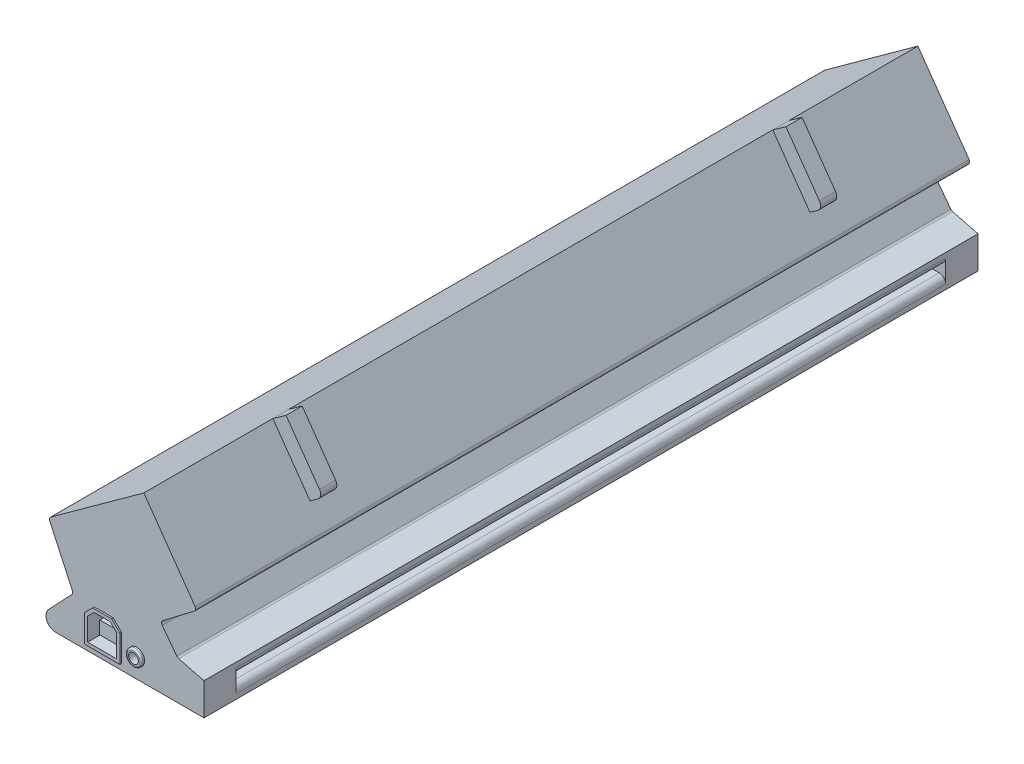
ISO-10303-21;
HEADER;
FILE_DESCRIPTION(('STEP AP214'),'2;1');
FILE_NAME('part.step','',(''),(''),'','','');
FILE_SCHEMA(('AUTOMOTIVE_DESIGN { 1 0 10303 214 1 1 1 1 }'));
ENDSEC;
DATA;
#1=APPLICATION_CONTEXT('core data for automotive mechanical design processes');
#2=APPLICATION_PROTOCOL_DEFINITION('international standard','automotive_design',2000,#1);
#3=PRODUCT_CONTEXT('',#1,'mechanical');
#4=PRODUCT('Part','Part','',(#3));
#5=PRODUCT_RELATED_PRODUCT_CATEGORY('part','',(#4));
#6=PRODUCT_DEFINITION_FORMATION('','',#4);
#7=PRODUCT_DEFINITION_CONTEXT('part definition',#1,'design');
#8=PRODUCT_DEFINITION('design','',#6,#7);
#9=PRODUCT_DEFINITION_SHAPE('','',#8);
#10=(LENGTH_UNIT() NAMED_UNIT(*) SI_UNIT(.MILLI.,.METRE.));
#11=(NAMED_UNIT(*) PLANE_ANGLE_UNIT() SI_UNIT($,.RADIAN.));
#12=(NAMED_UNIT(*) SI_UNIT($,.STERADIAN.) SOLID_ANGLE_UNIT());
#13=UNCERTAINTY_MEASURE_WITH_UNIT(LENGTH_MEASURE(1.E-05),#10,'distance_accuracy_value','');
#14=(GEOMETRIC_REPRESENTATION_CONTEXT(3) GLOBAL_UNCERTAINTY_ASSIGNED_CONTEXT((#13)) GLOBAL_UNIT_ASSIGNED_CONTEXT((#10,
#11,#12)) REPRESENTATION_CONTEXT('',''));
#15=CARTESIAN_POINT('',(0.,0.,0.));
#16=DIRECTION('',(0.,0.,1.));
#17=DIRECTION('',(1.,0.,0.));
#18=AXIS2_PLACEMENT_3D('',#15,#16,#17);
#19=CARTESIAN_POINT('',(-4.15611783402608,3.,120.));
#20=DIRECTION('',(0.,0.,-1.));
#21=DIRECTION('',(-1.,0.,0.));
#22=AXIS2_PLACEMENT_3D('',#19,#20,#21);
#23=PLANE('',#22);
#24=DIRECTION('',(-0.809922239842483,-0.586537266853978,0.));
#25=VECTOR('',#24,1.);
#26=CARTESIAN_POINT('',(23.1800658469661,51.0919973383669,120.));
#27=LINE('',#26,#25);
#28=CARTESIAN_POINT('',(23.1800658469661,51.0919973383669,120.));
#29=VERTEX_POINT('',#28);
#30=CARTESIAN_POINT('',(-5.67130495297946,30.1981345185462,120.));
#31=VERTEX_POINT('',#30);
#32=EDGE_CURVE('E574',#29,#31,#27,.T.);
#33=ORIENTED_EDGE('',*,*,#32,.T.);
#34=CARTESIAN_POINT('',(-5.08476768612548,29.3882122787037,120.));
#35=DIRECTION('',(0.,0.,-1.));
#36=DIRECTION('',(-1.,0.,0.));
#37=AXIS2_PLACEMENT_3D('',#34,#35,#36);
#38=CIRCLE('',#37,1.);
#39=CARTESIAN_POINT('',(-5.99223048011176,28.9680798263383,120.));
#40=VERTEX_POINT('',#39);
#41=EDGE_CURVE('E697',#31,#40,#38,.F.);
#42=ORIENTED_EDGE('',*,*,#41,.T.);
#43=DIRECTION('',(0.420132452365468,-0.907462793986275,0.));
#44=VECTOR('',#43,1.);
#45=CARTESIAN_POINT('',(-6.33813802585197,29.7152209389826,120.));
#46=LINE('',#45,#44);
#47=CARTESIAN_POINT('',(1.03531272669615,13.7889762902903,120.));
#48=VERTEX_POINT('',#47);
#49=EDGE_CURVE('E577',#40,#48,#46,.T.);
#50=ORIENTED_EDGE('',*,*,#49,.T.);
#51=CARTESIAN_POINT('',(0.127849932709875,13.3688438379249,120.));
#52=DIRECTION('',(0.,0.,-1.));
#53=DIRECTION('',(-1.,0.,0.));
#54=AXIS2_PLACEMENT_3D('',#51,#52,#53);
#55=CIRCLE('',#54,1.);
#56=CARTESIAN_POINT('',(0.85518999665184,12.6825666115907,120.));
#57=VERTEX_POINT('',#56);
#58=EDGE_CURVE('E701',#48,#57,#55,.T.);
#59=ORIENTED_EDGE('',*,*,#58,.T.);
#60=DIRECTION('',(-0.686277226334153,-0.727340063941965,0.));
#61=VECTOR('',#60,1.);
#62=CARTESIAN_POINT('',(1.31965197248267,13.1748192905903,120.));
#63=LINE('',#62,#61);
#64=CARTESIAN_POINT('',(-6.33813802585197,5.05883167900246,120.));
#65=VERTEX_POINT('',#64);
#66=EDGE_CURVE('E580',#57,#65,#63,.T.);
#67=ORIENTED_EDGE('',*,*,#66,.T.);
#68=CARTESIAN_POINT('',(-4.15611783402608,3.,120.));
#69=DIRECTION('',(0.,0.,1.));
#70=DIRECTION('',(-1.,0.,0.));
#71=AXIS2_PLACEMENT_3D('',#68,#69,#70);
#72=CIRCLE('',#71,3.);
#73=CARTESIAN_POINT('',(-4.1561178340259,0.,120.));
#74=VERTEX_POINT('',#73);
#75=EDGE_CURVE('E582',#65,#74,#72,.T.);
#76=ORIENTED_EDGE('',*,*,#75,.T.);
#77=DIRECTION('',(1.,0.,0.));
#78=VECTOR('',#77,1.);
#79=CARTESIAN_POINT('',(-4.1561178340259,0.,120.));
#80=LINE('',#79,#78);
#81=CARTESIAN_POINT('',(41.8194673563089,0.,120.));
#82=VERTEX_POINT('',#81);
#83=EDGE_CURVE('E584',#74,#82,#80,.T.);
#84=ORIENTED_EDGE('',*,*,#83,.T.);
#85=DIRECTION('',(0.,1.,0.));
#86=VECTOR('',#85,1.);
#87=CARTESIAN_POINT('',(41.8194673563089,0.,120.));
#88=LINE('',#87,#86);
#89=CARTESIAN_POINT('',(41.8194673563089,10.,120.));
#90=VERTEX_POINT('',#89);
#91=EDGE_CURVE('E559',#82,#90,#88,.T.);
#92=ORIENTED_EDGE('',*,*,#91,.T.);
#93=DIRECTION('',(-0.968376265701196,0.249494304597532,0.));
#94=VECTOR('',#93,1.);
#95=CARTESIAN_POINT('',(41.8194673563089,10.,120.));
#96=LINE('',#95,#94);
#97=CARTESIAN_POINT('',(33.9630787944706,12.0241349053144,120.));
#98=VERTEX_POINT('',#97);
#99=EDGE_CURVE('E562',#90,#98,#96,.T.);
#100=ORIENTED_EDGE('',*,*,#99,.T.);
#101=CARTESIAN_POINT('',(34.2125730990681,12.9925111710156,120.));
#102=DIRECTION('',(0.,0.,-1.));
#103=DIRECTION('',(-1.,0.,0.));
#104=AXIS2_PLACEMENT_3D('',#101,#102,#103);
#105=CIRCLE('',#104,1.);
#106=CARTESIAN_POINT('',(33.416410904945,12.3874279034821,120.));
#107=VERTEX_POINT('',#106);
#108=EDGE_CURVE('E679',#98,#107,#105,.T.);
#109=ORIENTED_EDGE('',*,*,#108,.T.);
#110=DIRECTION('',(-0.605083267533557,0.796162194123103,0.));
#111=VECTOR('',#110,1.);
#112=CARTESIAN_POINT('',(33.6266353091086,12.1108168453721,120.));
#113=LINE('',#112,#111);
#114=CARTESIAN_POINT('',(28.878548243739,18.3582998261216,120.));
#115=VERTEX_POINT('',#114);
#116=EDGE_CURVE('E566',#107,#115,#113,.T.);
#117=ORIENTED_EDGE('',*,*,#116,.T.);
#118=CARTESIAN_POINT('',(29.6747104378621,18.9633830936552,120.));
#119=DIRECTION('',(0.,0.,-1.));
#120=DIRECTION('',(-1.,0.,0.));
#121=AXIS2_PLACEMENT_3D('',#118,#119,#120);
#122=CIRCLE('',#121,1.);
#123=CARTESIAN_POINT('',(29.0696271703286,19.7595452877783,120.));
#124=VERTEX_POINT('',#123);
#125=EDGE_CURVE('E683',#115,#124,#122,.T.);
#126=ORIENTED_EDGE('',*,*,#125,.T.);
#127=DIRECTION('',(0.796162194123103,0.605083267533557,0.));
#128=VECTOR('',#127,1.);
#129=CARTESIAN_POINT('',(28.2734649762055,19.1544620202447,120.));
#130=LINE('',#129,#128);
#131=CARTESIAN_POINT('',(38.8553771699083,27.1967152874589,120.));
#132=VERTEX_POINT('',#131);
#133=EDGE_CURVE('E569',#124,#132,#130,.T.);
#134=ORIENTED_EDGE('',*,*,#133,.T.);
#135=CARTESIAN_POINT('',(38.2502939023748,27.992877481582,120.));
#136=DIRECTION('',(0.,0.,-1.));
#137=DIRECTION('',(-1.,0.,0.));
#138=AXIS2_PLACEMENT_3D('',#135,#136,#137);
#139=CIRCLE('',#138,1.);
#140=CARTESIAN_POINT('',(39.0674496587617,28.5692944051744,120.));
#141=VERTEX_POINT('',#140);
#142=EDGE_CURVE('E668',#132,#141,#139,.F.);
#143=ORIENTED_EDGE('',*,*,#142,.T.);
#144=DIRECTION('',(-0.57641692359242,0.817155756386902,0.));
#145=VECTOR('',#144,1.);
#146=CARTESIAN_POINT('',(39.6237400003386,27.7806710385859,120.));
#147=LINE('',#146,#145);
#148=EDGE_CURVE('E572',#141,#29,#147,.T.);
#149=ORIENTED_EDGE('',*,*,#148,.T.);
#150=EDGE_LOOP('',(#33,#42,#50,#59,#67,#76,#84,#92,#100,#109,#117,#126,#134,#143,#149));
#151=FACE_BOUND('',#150,.T.);
#152=CARTESIAN_POINT('',(20.9661747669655,6.09417928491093,120.));
#153=DIRECTION('',(0.,0.,-1.));
#154=DIRECTION('',(-1.,0.,0.));
#155=AXIS2_PLACEMENT_3D('',#152,#153,#154);
#156=CIRCLE('',#155,2.47181233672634);
#157=CARTESIAN_POINT('',(18.4943624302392,6.09417928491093,120.));
#158=VERTEX_POINT('',#157);
#159=EDGE_CURVE('E649',#158,#158,#156,.F.);
#160=ORIENTED_EDGE('',*,*,#159,.F.);
#161=EDGE_LOOP('',(#160));
#162=FACE_BOUND('',#161,.T.);
#163=DIRECTION('',(1.,0.,0.));
#164=VECTOR('',#163,1.);
#165=CARTESIAN_POINT('',(16.2460472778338,1.81160664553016,120.));
#166=LINE('',#165,#164);
#167=CARTESIAN_POINT('',(5.24604727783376,1.81160664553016,120.));
#168=VERTEX_POINT('',#167);
#169=CARTESIAN_POINT('',(16.2460472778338,1.81160664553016,120.));
#170=VERTEX_POINT('',#169);
#171=EDGE_CURVE('E369',#168,#170,#166,.T.);
#172=ORIENTED_EDGE('',*,*,#171,.F.);
#173=DIRECTION('',(0.,-1.,0.));
#174=VECTOR('',#173,1.);
#175=CARTESIAN_POINT('',(5.24604727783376,1.81160664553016,120.));
#176=LINE('',#175,#174);
#177=CARTESIAN_POINT('',(5.24604727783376,10.2258202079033,120.));
#178=VERTEX_POINT('',#177);
#179=EDGE_CURVE('E374',#178,#168,#176,.T.);
#180=ORIENTED_EDGE('',*,*,#179,.F.);
#181=DIRECTION('',(-0.707106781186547,-0.707106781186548,0.));
#182=VECTOR('',#181,1.);
#183=CARTESIAN_POINT('',(5.24604727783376,10.2258202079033,120.));
#184=LINE('',#183,#182);
#185=CARTESIAN_POINT('',(7.83183371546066,12.8116066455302,120.));
#186=VERTEX_POINT('',#185);
#187=EDGE_CURVE('E396',#186,#178,#184,.T.);
#188=ORIENTED_EDGE('',*,*,#187,.F.);
#189=DIRECTION('',(-1.,0.,0.));
#190=VECTOR('',#189,1.);
#191=CARTESIAN_POINT('',(7.83183371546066,12.8116066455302,120.));
#192=LINE('',#191,#190);
#193=CARTESIAN_POINT('',(13.6602608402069,12.8116066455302,120.));
#194=VERTEX_POINT('',#193);
#195=EDGE_CURVE('E393',#194,#186,#192,.T.);
#196=ORIENTED_EDGE('',*,*,#195,.F.);
#197=DIRECTION('',(-0.707106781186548,0.707106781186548,0.));
#198=VECTOR('',#197,1.);
#199=CARTESIAN_POINT('',(13.6602608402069,12.8116066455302,120.));
#200=LINE('',#199,#198);
#201=CARTESIAN_POINT('',(16.2460472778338,10.2258202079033,120.));
#202=VERTEX_POINT('',#201);
#203=EDGE_CURVE('E390',#202,#194,#200,.T.);
#204=ORIENTED_EDGE('',*,*,#203,.F.);
#205=DIRECTION('',(0.,1.,0.));
#206=VECTOR('',#205,1.);
#207=CARTESIAN_POINT('',(16.2460472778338,10.2258202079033,120.));
#208=LINE('',#207,#206);
#209=EDGE_CURVE('E387',#170,#202,#208,.T.);
#210=ORIENTED_EDGE('',*,*,#209,.F.);
#211=EDGE_LOOP('',(#172,#180,#188,#196,#204,#210));
#212=FACE_BOUND('',#211,.T.);
#213=ADVANCED_FACE('F35',(#151,#162,#212),#23,.F.);
#214=CARTESIAN_POINT('',(39.6237400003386,27.7806710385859,120.));
#215=DIRECTION('',(-0.817155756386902,-0.57641692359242,0.));
#216=DIRECTION('',(0.57641692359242,-0.817155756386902,0.));
#217=AXIS2_PLACEMENT_3D('',#214,#215,#216);
#218=PLANE('',#217);
#219=ORIENTED_EDGE('',*,*,#148,.F.);
#220=DIRECTION('',(0.,0.,-1.));
#221=VECTOR('',#220,1.);
#222=CARTESIAN_POINT('',(39.0674496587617,28.5692944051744,120.));
#223=LINE('',#222,#221);
#224=CARTESIAN_POINT('',(39.0674496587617,28.5692944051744,-120.));
#225=VERTEX_POINT('',#224);
#226=EDGE_CURVE('E658',#141,#225,#223,.T.);
#227=ORIENTED_EDGE('',*,*,#226,.T.);
#228=DIRECTION('',(-0.57641692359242,0.817155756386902,0.));
#229=VECTOR('',#228,1.);
#230=CARTESIAN_POINT('',(39.6237400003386,27.7806710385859,-120.));
#231=LINE('',#230,#229);
#232=CARTESIAN_POINT('',(23.1800658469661,51.0919973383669,-120.));
#233=VERTEX_POINT('',#232);
#234=EDGE_CURVE('E598',#225,#233,#231,.T.);
#235=ORIENTED_EDGE('',*,*,#234,.T.);
#236=DIRECTION('',(0.,0.,-1.));
#237=VECTOR('',#236,1.);
#238=CARTESIAN_POINT('',(23.1800658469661,51.0919973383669,120.));
#239=LINE('',#238,#237);
#240=CARTESIAN_POINT('',(23.1800658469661,51.0919973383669,-80.));
#241=VERTEX_POINT('',#240);
#242=EDGE_CURVE('E619',#241,#233,#239,.T.);
#243=ORIENTED_EDGE('',*,*,#242,.F.);
#244=DIRECTION('',(-0.576416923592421,0.817155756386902,0.));
#245=VECTOR('',#244,1.);
#246=CARTESIAN_POINT('',(23.1800658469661,51.0919973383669,-80.));
#247=LINE('',#246,#245);
#248=CARTESIAN_POINT('',(34.7084043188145,34.7488822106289,-80.));
#249=VERTEX_POINT('',#248);
#250=EDGE_CURVE('E495',#249,#241,#247,.T.);
#251=ORIENTED_EDGE('',*,*,#250,.F.);
#252=DIRECTION('',(0.,0.,-1.));
#253=VECTOR('',#252,1.);
#254=CARTESIAN_POINT('',(34.7084043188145,34.7488822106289,-80.));
#255=LINE('',#254,#253);
#256=CARTESIAN_POINT('',(34.7084043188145,34.7488822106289,-75.));
#257=VERTEX_POINT('',#256);
#258=EDGE_CURVE('E507',#257,#249,#255,.T.);
#259=ORIENTED_EDGE('',*,*,#258,.F.);
#260=DIRECTION('',(0.576416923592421,-0.817155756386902,0.));
#261=VECTOR('',#260,1.);
#262=CARTESIAN_POINT('',(28.9442350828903,42.9204397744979,-75.));
#263=LINE('',#262,#261);
#264=CARTESIAN_POINT('',(23.1800658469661,51.0919973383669,-75.));
#265=VERTEX_POINT('',#264);
#266=EDGE_CURVE('E516',#265,#257,#263,.T.);
#267=ORIENTED_EDGE('',*,*,#266,.F.);
#268=CARTESIAN_POINT('',(23.1800658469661,51.0919973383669,75.));
#269=VERTEX_POINT('',#268);
#270=EDGE_CURVE('E624',#269,#265,#239,.T.);
#271=ORIENTED_EDGE('',*,*,#270,.F.);
#272=DIRECTION('',(-0.57641692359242,0.817155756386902,0.));
#273=VECTOR('',#272,1.);
#274=CARTESIAN_POINT('',(23.1800658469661,51.0919973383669,75.));
#275=LINE('',#274,#273);
#276=CARTESIAN_POINT('',(34.7084043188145,34.7488822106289,75.));
#277=VERTEX_POINT('',#276);
#278=EDGE_CURVE('E535',#277,#269,#275,.T.);
#279=ORIENTED_EDGE('',*,*,#278,.F.);
#280=DIRECTION('',(0.,0.,-1.));
#281=VECTOR('',#280,1.);
#282=CARTESIAN_POINT('',(34.7084043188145,34.7488822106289,75.));
#283=LINE('',#282,#281);
#284=CARTESIAN_POINT('',(34.7084043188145,34.7488822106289,80.));
#285=VERTEX_POINT('',#284);
#286=EDGE_CURVE('E546',#285,#277,#283,.T.);
#287=ORIENTED_EDGE('',*,*,#286,.F.);
#288=DIRECTION('',(0.57641692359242,-0.817155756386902,0.));
#289=VECTOR('',#288,1.);
#290=CARTESIAN_POINT('',(34.7084043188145,34.7488822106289,80.));
#291=LINE('',#290,#289);
#292=CARTESIAN_POINT('',(23.1800658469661,51.0919973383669,80.));
#293=VERTEX_POINT('',#292);
#294=EDGE_CURVE('E543',#293,#285,#291,.T.);
#295=ORIENTED_EDGE('',*,*,#294,.F.);
#296=EDGE_CURVE('E620',#29,#293,#239,.T.);
#297=ORIENTED_EDGE('',*,*,#296,.F.);
#298=EDGE_LOOP('',(#219,#227,#235,#243,#251,#259,#267,#271,#279,#287,#295,#297));
#299=FACE_BOUND('',#298,.T.);
#300=ADVANCED_FACE('F741',(#299),#218,.F.);
#301=CARTESIAN_POINT('',(41.8194673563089,0.,120.));
#302=DIRECTION('',(-1.,0.,0.));
#303=DIRECTION('',(0.,0.,1.));
#304=AXIS2_PLACEMENT_3D('',#301,#302,#303);
#305=PLANE('',#304);
#306=DIRECTION('',(0.,1.,0.));
#307=VECTOR('',#306,1.);
#308=CARTESIAN_POINT('',(41.8194673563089,6.5,-110.));
#309=LINE('',#308,#307);
#310=CARTESIAN_POINT('',(41.8194673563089,1.5,-110.));
#311=VERTEX_POINT('',#310);
#312=CARTESIAN_POINT('',(41.8194673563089,8.5,-110.));
#313=VERTEX_POINT('',#312);
#314=EDGE_CURVE('E468',#311,#313,#309,.T.);
#315=ORIENTED_EDGE('',*,*,#314,.F.);
#316=DIRECTION('',(0.,0.,-1.));
#317=VECTOR('',#316,1.);
#318=CARTESIAN_POINT('',(41.8194673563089,1.5,120.));
#319=LINE('',#318,#317);
#320=CARTESIAN_POINT('',(41.8194673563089,1.5,110.));
#321=VERTEX_POINT('',#320);
#322=EDGE_CURVE('E633',#311,#321,#319,.F.);
#323=ORIENTED_EDGE('',*,*,#322,.T.);
#324=DIRECTION('',(0.,-1.,0.));
#325=VECTOR('',#324,1.);
#326=CARTESIAN_POINT('',(41.8194673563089,6.5,110.));
#327=LINE('',#326,#325);
#328=CARTESIAN_POINT('',(41.8194673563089,8.5,110.));
#329=VERTEX_POINT('',#328);
#330=EDGE_CURVE('E480',#329,#321,#327,.T.);
#331=ORIENTED_EDGE('',*,*,#330,.F.);
#332=DIRECTION('',(0.,0.,1.));
#333=VECTOR('',#332,1.);
#334=CARTESIAN_POINT('',(41.8194673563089,8.5,120.));
#335=LINE('',#334,#333);
#336=EDGE_CURVE('E630',#329,#313,#335,.F.);
#337=ORIENTED_EDGE('',*,*,#336,.T.);
#338=EDGE_LOOP('',(#315,#323,#331,#337));
#339=FACE_BOUND('',#338,.T.);
#340=DIRECTION('',(0.,1.,0.));
#341=VECTOR('',#340,1.);
#342=CARTESIAN_POINT('',(41.8194673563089,0.,-120.));
#343=LINE('',#342,#341);
#344=CARTESIAN_POINT('',(41.8194673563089,0.,-120.));
#345=VERTEX_POINT('',#344);
#346=CARTESIAN_POINT('',(41.8194673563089,10.,-120.));
#347=VERTEX_POINT('',#346);
#348=EDGE_CURVE('E558',#345,#347,#343,.T.);
#349=ORIENTED_EDGE('',*,*,#348,.T.);
#350=DIRECTION('',(0.,0.,-1.));
#351=VECTOR('',#350,1.);
#352=CARTESIAN_POINT('',(41.8194673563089,10.,120.));
#353=LINE('',#352,#351);
#354=EDGE_CURVE('E623',#90,#347,#353,.T.);
#355=ORIENTED_EDGE('',*,*,#354,.F.);
#356=ORIENTED_EDGE('',*,*,#91,.F.);
#357=DIRECTION('',(0.,0.,-1.));
#358=VECTOR('',#357,1.);
#359=CARTESIAN_POINT('',(41.8194673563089,0.,120.));
#360=LINE('',#359,#358);
#361=EDGE_CURVE('E586',#82,#345,#360,.T.);
#362=ORIENTED_EDGE('',*,*,#361,.T.);
#363=EDGE_LOOP('',(#349,#355,#356,#362));
#364=FACE_BOUND('',#363,.T.);
#365=ADVANCED_FACE('F749',(#339,#364),#305,.F.);
#366=CARTESIAN_POINT('',(41.8194673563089,10.,120.));
#367=DIRECTION('',(-0.249494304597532,-0.968376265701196,0.));
#368=DIRECTION('',(0.968376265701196,-0.249494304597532,0.));
#369=AXIS2_PLACEMENT_3D('',#366,#367,#368);
#370=PLANE('',#369);
#371=DIRECTION('',(-0.968376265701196,0.249494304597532,0.));
#372=VECTOR('',#371,1.);
#373=CARTESIAN_POINT('',(41.8194673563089,10.,-120.));
#374=LINE('',#373,#372);
#375=CARTESIAN_POINT('',(33.9630787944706,12.0241349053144,-120.));
#376=VERTEX_POINT('',#375);
#377=EDGE_CURVE('E589',#347,#376,#374,.T.);
#378=ORIENTED_EDGE('',*,*,#377,.T.);
#379=DIRECTION('',(0.,0.,-1.));
#380=VECTOR('',#379,1.);
#381=CARTESIAN_POINT('',(33.9630787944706,12.0241349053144,120.));
#382=LINE('',#381,#380);
#383=EDGE_CURVE('E675',#376,#98,#382,.F.);
#384=ORIENTED_EDGE('',*,*,#383,.T.);
#385=ORIENTED_EDGE('',*,*,#99,.F.);
#386=ORIENTED_EDGE('',*,*,#354,.T.);
#387=EDGE_LOOP('',(#378,#384,#385,#386));
#388=FACE_BOUND('',#387,.T.);
#389=ADVANCED_FACE('F786',(#388),#370,.F.);
#390=CARTESIAN_POINT('',(33.6266353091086,12.1108168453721,120.));
#391=DIRECTION('',(-0.796162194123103,-0.605083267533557,0.));
#392=DIRECTION('',(0.605083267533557,-0.796162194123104,0.));
#393=AXIS2_PLACEMENT_3D('',#390,#391,#392);
#394=PLANE('',#393);
#395=ORIENTED_EDGE('',*,*,#116,.F.);
#396=DIRECTION('',(0.,0.,-1.));
#397=VECTOR('',#396,1.);
#398=CARTESIAN_POINT('',(33.416410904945,12.3874279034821,-120.));
#399=LINE('',#398,#397);
#400=CARTESIAN_POINT('',(33.416410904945,12.3874279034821,-120.));
#401=VERTEX_POINT('',#400);
#402=EDGE_CURVE('E672',#107,#401,#399,.T.);
#403=ORIENTED_EDGE('',*,*,#402,.T.);
#404=DIRECTION('',(-0.605083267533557,0.796162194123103,0.));
#405=VECTOR('',#404,1.);
#406=CARTESIAN_POINT('',(33.6266353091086,12.1108168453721,-120.));
#407=LINE('',#406,#405);
#408=CARTESIAN_POINT('',(28.878548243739,18.3582998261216,-120.));
#409=VERTEX_POINT('',#408);
#410=EDGE_CURVE('E592',#401,#409,#407,.T.);
#411=ORIENTED_EDGE('',*,*,#410,.T.);
#412=DIRECTION('',(0.,0.,-1.));
#413=VECTOR('',#412,1.);
#414=CARTESIAN_POINT('',(28.878548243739,18.3582998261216,120.));
#415=LINE('',#414,#413);
#416=EDGE_CURVE('E670',#409,#115,#415,.F.);
#417=ORIENTED_EDGE('',*,*,#416,.T.);
#418=EDGE_LOOP('',(#395,#403,#411,#417));
#419=FACE_BOUND('',#418,.T.);
#420=ADVANCED_FACE('F782',(#419),#394,.F.);
#421=CARTESIAN_POINT('',(28.2734649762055,19.1544620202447,120.));
#422=DIRECTION('',(-0.605083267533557,0.796162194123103,0.));
#423=DIRECTION('',(-0.796162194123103,-0.605083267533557,0.));
#424=AXIS2_PLACEMENT_3D('',#421,#422,#423);
#425=PLANE('',#424);
#426=DIRECTION('',(0.796162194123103,0.605083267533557,0.));
#427=VECTOR('',#426,1.);
#428=CARTESIAN_POINT('',(28.2734649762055,19.1544620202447,-120.));
#429=LINE('',#428,#427);
#430=CARTESIAN_POINT('',(29.0696271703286,19.7595452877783,-120.));
#431=VERTEX_POINT('',#430);
#432=CARTESIAN_POINT('',(38.8553771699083,27.1967152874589,-120.));
#433=VERTEX_POINT('',#432);
#434=EDGE_CURVE('E595',#431,#433,#429,.T.);
#435=ORIENTED_EDGE('',*,*,#434,.T.);
#436=DIRECTION('',(0.,0.,-1.));
#437=VECTOR('',#436,1.);
#438=CARTESIAN_POINT('',(38.8553771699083,27.1967152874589,120.));
#439=LINE('',#438,#437);
#440=EDGE_CURVE('E666',#433,#132,#439,.F.);
#441=ORIENTED_EDGE('',*,*,#440,.T.);
#442=ORIENTED_EDGE('',*,*,#133,.F.);
#443=DIRECTION('',(0.,0.,-1.));
#444=VECTOR('',#443,1.);
#445=CARTESIAN_POINT('',(29.0696271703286,19.7595452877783,-120.));
#446=LINE('',#445,#444);
#447=EDGE_CURVE('E663',#124,#431,#446,.T.);
#448=ORIENTED_EDGE('',*,*,#447,.T.);
#449=EDGE_LOOP('',(#435,#441,#442,#448));
#450=FACE_BOUND('',#449,.T.);
#451=ADVANCED_FACE('F777',(#450),#425,.F.);
#452=CARTESIAN_POINT('',(23.1800658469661,51.0919973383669,120.));
#453=DIRECTION('',(0.586537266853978,-0.809922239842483,0.));
#454=DIRECTION('',(0.809922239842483,0.586537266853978,0.));
#455=AXIS2_PLACEMENT_3D('',#452,#453,#454);
#456=PLANE('',#455);
#457=DIRECTION('',(-0.809922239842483,-0.586537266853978,0.));
#458=VECTOR('',#457,1.);
#459=CARTESIAN_POINT('',(23.1800658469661,51.0919973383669,-120.));
#460=LINE('',#459,#458);
#461=CARTESIAN_POINT('',(-5.67130495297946,30.1981345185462,-120.));
#462=VERTEX_POINT('',#461);
#463=EDGE_CURVE('E600',#233,#462,#460,.T.);
#464=ORIENTED_EDGE('',*,*,#463,.T.);
#465=DIRECTION('',(0.,0.,-1.));
#466=VECTOR('',#465,1.);
#467=CARTESIAN_POINT('',(-5.67130495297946,30.1981345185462,120.));
#468=LINE('',#467,#466);
#469=EDGE_CURVE('E695',#462,#31,#468,.F.);
#470=ORIENTED_EDGE('',*,*,#469,.T.);
#471=ORIENTED_EDGE('',*,*,#32,.F.);
#472=ORIENTED_EDGE('',*,*,#296,.T.);
#473=DIRECTION('',(0.,0.,1.));
#474=VECTOR('',#473,1.);
#475=CARTESIAN_POINT('',(23.1800658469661,51.0919973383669,80.));
#476=LINE('',#475,#474);
#477=EDGE_CURVE('E530',#269,#293,#476,.T.);
#478=ORIENTED_EDGE('',*,*,#477,.F.);
#479=ORIENTED_EDGE('',*,*,#270,.T.);
#480=DIRECTION('',(0.,0.,1.));
#481=VECTOR('',#480,1.);
#482=CARTESIAN_POINT('',(23.1800658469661,51.0919973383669,-75.));
#483=LINE('',#482,#481);
#484=EDGE_CURVE('E514',#241,#265,#483,.T.);
#485=ORIENTED_EDGE('',*,*,#484,.F.);
#486=ORIENTED_EDGE('',*,*,#242,.T.);
#487=EDGE_LOOP('',(#464,#470,#471,#472,#478,#479,#485,#486));
#488=FACE_BOUND('',#487,.T.);
#489=ADVANCED_FACE('F775',(#488),#456,.F.);
#490=CARTESIAN_POINT('',(-6.33813802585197,29.7152209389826,120.));
#491=DIRECTION('',(0.907462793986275,0.420132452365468,0.));
#492=DIRECTION('',(-0.420132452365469,0.907462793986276,0.));
#493=AXIS2_PLACEMENT_3D('',#490,#491,#492);
#494=PLANE('',#493);
#495=DIRECTION('',(0.420132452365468,-0.907462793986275,0.));
#496=VECTOR('',#495,1.);
#497=CARTESIAN_POINT('',(-6.33813802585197,29.7152209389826,-120.));
#498=LINE('',#497,#496);
#499=CARTESIAN_POINT('',(-5.99223048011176,28.9680798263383,-120.));
#500=VERTEX_POINT('',#499);
#501=CARTESIAN_POINT('',(1.03531272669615,13.7889762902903,-120.));
#502=VERTEX_POINT('',#501);
#503=EDGE_CURVE('E603',#500,#502,#498,.T.);
#504=ORIENTED_EDGE('',*,*,#503,.T.);
#505=DIRECTION('',(0.,0.,-1.));
#506=VECTOR('',#505,1.);
#507=CARTESIAN_POINT('',(1.03531272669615,13.7889762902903,120.));
#508=LINE('',#507,#506);
#509=EDGE_CURVE('E691',#502,#48,#508,.F.);
#510=ORIENTED_EDGE('',*,*,#509,.T.);
#511=ORIENTED_EDGE('',*,*,#49,.F.);
#512=DIRECTION('',(0.,0.,-1.));
#513=VECTOR('',#512,1.);
#514=CARTESIAN_POINT('',(-5.99223048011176,28.9680798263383,120.));
#515=LINE('',#514,#513);
#516=EDGE_CURVE('E688',#40,#500,#515,.T.);
#517=ORIENTED_EDGE('',*,*,#516,.T.);
#518=EDGE_LOOP('',(#504,#510,#511,#517));
#519=FACE_BOUND('',#518,.T.);
#520=ADVANCED_FACE('F771',(#519),#494,.F.);
#521=CARTESIAN_POINT('',(1.31965197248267,13.1748192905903,120.));
#522=DIRECTION('',(0.727340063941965,-0.686277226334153,0.));
#523=DIRECTION('',(0.686277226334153,0.727340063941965,0.));
#524=AXIS2_PLACEMENT_3D('',#521,#522,#523);
#525=PLANE('',#524);
#526=ORIENTED_EDGE('',*,*,#66,.F.);
#527=DIRECTION('',(0.,0.,-1.));
#528=VECTOR('',#527,1.);
#529=CARTESIAN_POINT('',(0.85518999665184,12.6825666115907,-120.));
#530=LINE('',#529,#528);
#531=CARTESIAN_POINT('',(0.85518999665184,12.6825666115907,-120.));
#532=VERTEX_POINT('',#531);
#533=EDGE_CURVE('E685',#57,#532,#530,.T.);
#534=ORIENTED_EDGE('',*,*,#533,.T.);
#535=DIRECTION('',(-0.686277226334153,-0.727340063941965,0.));
#536=VECTOR('',#535,1.);
#537=CARTESIAN_POINT('',(1.31965197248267,13.1748192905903,-120.));
#538=LINE('',#537,#536);
#539=CARTESIAN_POINT('',(-6.33813802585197,5.05883167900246,-120.));
#540=VERTEX_POINT('',#539);
#541=EDGE_CURVE('E606',#532,#540,#538,.T.);
#542=ORIENTED_EDGE('',*,*,#541,.T.);
#543=DIRECTION('',(0.,0.,-1.));
#544=VECTOR('',#543,1.);
#545=CARTESIAN_POINT('',(-6.33813802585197,5.05883167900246,120.));
#546=LINE('',#545,#544);
#547=EDGE_CURVE('E616',#65,#540,#546,.T.);
#548=ORIENTED_EDGE('',*,*,#547,.F.);
#549=EDGE_LOOP('',(#526,#534,#542,#548));
#550=FACE_BOUND('',#549,.T.);
#551=ADVANCED_FACE('F767',(#550),#525,.F.);
#552=CARTESIAN_POINT('',(-4.15611783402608,3.,120.));
#553=DIRECTION('',(0.,0.,-1.));
#554=DIRECTION('',(-1.,0.,0.));
#555=AXIS2_PLACEMENT_3D('',#552,#553,#554);
#556=CYLINDRICAL_SURFACE('',#555,3.);
#557=CARTESIAN_POINT('',(-4.15611783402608,3.,-120.));
#558=DIRECTION('',(0.,0.,1.));
#559=DIRECTION('',(-1.,0.,0.));
#560=AXIS2_PLACEMENT_3D('',#557,#558,#559);
#561=CIRCLE('',#560,3.);
#562=CARTESIAN_POINT('',(-4.1561178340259,0.,-120.));
#563=VERTEX_POINT('',#562);
#564=EDGE_CURVE('E608',#540,#563,#561,.T.);
#565=ORIENTED_EDGE('',*,*,#564,.T.);
#566=DIRECTION('',(0.,0.,-1.));
#567=VECTOR('',#566,1.);
#568=CARTESIAN_POINT('',(-4.1561178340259,0.,120.));
#569=LINE('',#568,#567);
#570=EDGE_CURVE('E613',#74,#563,#569,.T.);
#571=ORIENTED_EDGE('',*,*,#570,.F.);
#572=ORIENTED_EDGE('',*,*,#75,.F.);
#573=ORIENTED_EDGE('',*,*,#547,.T.);
#574=EDGE_LOOP('',(#565,#571,#572,#573));
#575=FACE_BOUND('',#574,.T.);
#576=ADVANCED_FACE('F763',(#575),#556,.T.);
#577=CARTESIAN_POINT('',(-4.1561178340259,0.,120.));
#578=DIRECTION('',(0.,1.,0.));
#579=DIRECTION('',(0.,0.,1.));
#580=AXIS2_PLACEMENT_3D('',#577,#578,#579);
#581=PLANE('',#580);
#582=DIRECTION('',(1.,0.,0.));
#583=VECTOR('',#582,1.);
#584=CARTESIAN_POINT('',(-4.1561178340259,0.,-120.));
#585=LINE('',#584,#583);
#586=EDGE_CURVE('E563',#563,#345,#585,.T.);
#587=ORIENTED_EDGE('',*,*,#586,.T.);
#588=ORIENTED_EDGE('',*,*,#361,.F.);
#589=ORIENTED_EDGE('',*,*,#83,.F.);
#590=ORIENTED_EDGE('',*,*,#570,.T.);
#591=EDGE_LOOP('',(#587,#588,#589,#590));
#592=FACE_BOUND('',#591,.T.);
#593=ADVANCED_FACE('F759',(#592),#581,.F.);
#594=CARTESIAN_POINT('',(-4.15611783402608,3.,-120.));
#595=DIRECTION('',(0.,0.,-1.));
#596=DIRECTION('',(-1.,0.,0.));
#597=AXIS2_PLACEMENT_3D('',#594,#595,#596);
#598=PLANE('',#597);
#599=ORIENTED_EDGE('',*,*,#503,.F.);
#600=CARTESIAN_POINT('',(-5.08476768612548,29.3882122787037,-120.));
#601=DIRECTION('',(0.,0.,-1.));
#602=DIRECTION('',(-1.,0.,0.));
#603=AXIS2_PLACEMENT_3D('',#600,#601,#602);
#604=CIRCLE('',#603,1.);
#605=EDGE_CURVE('E693',#500,#462,#604,.T.);
#606=ORIENTED_EDGE('',*,*,#605,.T.);
#607=ORIENTED_EDGE('',*,*,#463,.F.);
#608=ORIENTED_EDGE('',*,*,#234,.F.);
#609=CARTESIAN_POINT('',(38.2502939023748,27.992877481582,-120.));
#610=DIRECTION('',(0.,0.,-1.));
#611=DIRECTION('',(-1.,0.,0.));
#612=AXIS2_PLACEMENT_3D('',#609,#610,#611);
#613=CIRCLE('',#612,1.);
#614=EDGE_CURVE('E661',#225,#433,#613,.T.);
#615=ORIENTED_EDGE('',*,*,#614,.T.);
#616=ORIENTED_EDGE('',*,*,#434,.F.);
#617=CARTESIAN_POINT('',(29.6747104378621,18.9633830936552,-120.));
#618=DIRECTION('',(0.,0.,-1.));
#619=DIRECTION('',(-1.,0.,0.));
#620=AXIS2_PLACEMENT_3D('',#617,#618,#619);
#621=CIRCLE('',#620,1.);
#622=EDGE_CURVE('E681',#431,#409,#621,.F.);
#623=ORIENTED_EDGE('',*,*,#622,.T.);
#624=ORIENTED_EDGE('',*,*,#410,.F.);
#625=CARTESIAN_POINT('',(34.2125730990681,12.9925111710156,-120.));
#626=DIRECTION('',(0.,0.,-1.));
#627=DIRECTION('',(-1.,0.,0.));
#628=AXIS2_PLACEMENT_3D('',#625,#626,#627);
#629=CIRCLE('',#628,1.);
#630=EDGE_CURVE('E677',#401,#376,#629,.F.);
#631=ORIENTED_EDGE('',*,*,#630,.T.);
#632=ORIENTED_EDGE('',*,*,#377,.F.);
#633=ORIENTED_EDGE('',*,*,#348,.F.);
#634=ORIENTED_EDGE('',*,*,#586,.F.);
#635=ORIENTED_EDGE('',*,*,#564,.F.);
#636=ORIENTED_EDGE('',*,*,#541,.F.);
#637=CARTESIAN_POINT('',(0.127849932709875,13.3688438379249,-120.));
#638=DIRECTION('',(0.,0.,-1.));
#639=DIRECTION('',(-1.,0.,0.));
#640=AXIS2_PLACEMENT_3D('',#637,#638,#639);
#641=CIRCLE('',#640,1.);
#642=EDGE_CURVE('E699',#532,#502,#641,.F.);
#643=ORIENTED_EDGE('',*,*,#642,.T.);
#644=EDGE_LOOP('',(#599,#606,#607,#608,#615,#616,#623,#624,#631,#632,#633,#634,#635,#636,#643));
#645=FACE_BOUND('',#644,.T.);
#646=ADVANCED_FACE('F756',(#645),#598,.T.);
#647=CARTESIAN_POINT('',(27.2658446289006,53.974081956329,80.));
#648=DIRECTION('',(0.57641692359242,-0.817155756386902,0.));
#649=DIRECTION('',(0.817155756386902,0.57641692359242,0.));
#650=AXIS2_PLACEMENT_3D('',#647,#648,#649);
#651=PLANE('',#650);
#652=ORIENTED_EDGE('',*,*,#477,.T.);
#653=DIRECTION('',(-0.817155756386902,-0.57641692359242,0.));
#654=VECTOR('',#653,1.);
#655=CARTESIAN_POINT('',(27.2658446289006,53.974081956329,80.));
#656=LINE('',#655,#654);
#657=CARTESIAN_POINT('',(27.2658446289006,53.974081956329,80.));
#658=VERTEX_POINT('',#657);
#659=EDGE_CURVE('E556',#658,#293,#656,.T.);
#660=ORIENTED_EDGE('',*,*,#659,.F.);
#661=DIRECTION('',(0.,0.,1.));
#662=VECTOR('',#661,1.);
#663=CARTESIAN_POINT('',(27.2658446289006,53.974081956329,80.));
#664=LINE('',#663,#662);
#665=CARTESIAN_POINT('',(27.2658446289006,53.974081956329,75.));
#666=VERTEX_POINT('',#665);
#667=EDGE_CURVE('E531',#666,#658,#664,.T.);
#668=ORIENTED_EDGE('',*,*,#667,.F.);
#669=DIRECTION('',(-0.817155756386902,-0.57641692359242,0.));
#670=VECTOR('',#669,1.);
#671=CARTESIAN_POINT('',(27.2658446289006,53.974081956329,75.));
#672=LINE('',#671,#670);
#673=EDGE_CURVE('E540',#666,#269,#672,.T.);
#674=ORIENTED_EDGE('',*,*,#673,.T.);
#675=EDGE_LOOP('',(#652,#660,#668,#674));
#676=FACE_BOUND('',#675,.T.);
#677=ADVANCED_FACE('F727',(#676),#651,.F.);
#678=CARTESIAN_POINT('',(38.794183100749,37.630966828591,80.));
#679=DIRECTION('',(0.,0.,-1.));
#680=DIRECTION('',(-1.,0.,0.));
#681=AXIS2_PLACEMENT_3D('',#678,#679,#680);
#682=PLANE('',#681);
#683=DIRECTION('',(-0.817155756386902,-0.57641692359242,0.));
#684=VECTOR('',#683,1.);
#685=CARTESIAN_POINT('',(38.794183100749,37.630966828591,80.));
#686=LINE('',#685,#684);
#687=CARTESIAN_POINT('',(37.1598715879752,36.4781329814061,80.));
#688=VERTEX_POINT('',#687);
#689=EDGE_CURVE('E554',#688,#285,#686,.T.);
#690=ORIENTED_EDGE('',*,*,#689,.F.);
#691=CARTESIAN_POINT('',(36.0070377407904,38.1124444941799,80.));
#692=DIRECTION('',(0.,0.,-1.));
#693=DIRECTION('',(-1.,0.,0.));
#694=AXIS2_PLACEMENT_3D('',#691,#692,#693);
#695=CIRCLE('',#694,2.);
#696=CARTESIAN_POINT('',(37.6413492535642,39.2652783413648,80.));
#697=VERTEX_POINT('',#696);
#698=EDGE_CURVE('E11',#688,#697,#695,.F.);
#699=ORIENTED_EDGE('',*,*,#698,.T.);
#700=DIRECTION('',(0.57641692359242,-0.817155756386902,0.));
#701=VECTOR('',#700,1.);
#702=CARTESIAN_POINT('',(38.794183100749,37.630966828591,80.));
#703=LINE('',#702,#701);
#704=EDGE_CURVE('E534',#658,#697,#703,.T.);
#705=ORIENTED_EDGE('',*,*,#704,.F.);
#706=ORIENTED_EDGE('',*,*,#659,.T.);
#707=ORIENTED_EDGE('',*,*,#294,.T.);
#708=EDGE_LOOP('',(#690,#699,#705,#706,#707));
#709=FACE_BOUND('',#708,.T.);
#710=ADVANCED_FACE('F731',(#709),#682,.F.);
#711=CARTESIAN_POINT('',(38.794183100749,37.630966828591,75.));
#712=DIRECTION('',(-0.57641692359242,0.817155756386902,0.));
#713=DIRECTION('',(-0.817155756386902,-0.57641692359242,0.));
#714=AXIS2_PLACEMENT_3D('',#711,#712,#713);
#715=PLANE('',#714);
#716=DIRECTION('',(-0.817155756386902,-0.57641692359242,0.));
#717=VECTOR('',#716,1.);
#718=CARTESIAN_POINT('',(38.794183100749,37.630966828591,75.));
#719=LINE('',#718,#717);
#720=CARTESIAN_POINT('',(37.1598715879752,36.4781329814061,75.));
#721=VERTEX_POINT('',#720);
#722=EDGE_CURVE('E552',#721,#277,#719,.T.);
#723=ORIENTED_EDGE('',*,*,#722,.F.);
#724=DIRECTION('',(0.,0.,-1.));
#725=VECTOR('',#724,1.);
#726=CARTESIAN_POINT('',(37.1598715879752,36.4781329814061,75.));
#727=LINE('',#726,#725);
#728=EDGE_CURVE('E43',#721,#688,#727,.F.);
#729=ORIENTED_EDGE('',*,*,#728,.T.);
#730=ORIENTED_EDGE('',*,*,#689,.T.);
#731=ORIENTED_EDGE('',*,*,#286,.T.);
#732=EDGE_LOOP('',(#723,#729,#730,#731));
#733=FACE_BOUND('',#732,.T.);
#734=ADVANCED_FACE('F919',(#733),#715,.F.);
#735=CARTESIAN_POINT('',(27.2658446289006,53.974081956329,75.));
#736=DIRECTION('',(0.,0.,1.));
#737=DIRECTION('',(0.,-1.,0.));
#738=AXIS2_PLACEMENT_3D('',#735,#736,#737);
#739=PLANE('',#738);
#740=DIRECTION('',(-0.576416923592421,0.817155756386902,0.));
#741=VECTOR('',#740,1.);
#742=CARTESIAN_POINT('',(33.0300138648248,45.80252439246,75.));
#743=LINE('',#742,#741);
#744=CARTESIAN_POINT('',(37.6413492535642,39.2652783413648,75.));
#745=VERTEX_POINT('',#744);
#746=EDGE_CURVE('E538',#745,#666,#743,.T.);
#747=ORIENTED_EDGE('',*,*,#746,.F.);
#748=CARTESIAN_POINT('',(36.0070377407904,38.1124444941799,75.));
#749=DIRECTION('',(0.,0.,1.));
#750=DIRECTION('',(0.,-1.,0.));
#751=AXIS2_PLACEMENT_3D('',#748,#749,#750);
#752=CIRCLE('',#751,2.);
#753=EDGE_CURVE('E57',#745,#721,#752,.F.);
#754=ORIENTED_EDGE('',*,*,#753,.T.);
#755=ORIENTED_EDGE('',*,*,#722,.T.);
#756=ORIENTED_EDGE('',*,*,#278,.T.);
#757=ORIENTED_EDGE('',*,*,#673,.F.);
#758=EDGE_LOOP('',(#747,#754,#755,#756,#757));
#759=FACE_BOUND('',#758,.T.);
#760=ADVANCED_FACE('F721',(#759),#739,.F.);
#761=CARTESIAN_POINT('',(43.6295933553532,30.7760617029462,0.));
#762=DIRECTION('',(-0.817155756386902,-0.57641692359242,0.));
#763=DIRECTION('',(0.57641692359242,-0.817155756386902,0.));
#764=AXIS2_PLACEMENT_3D('',#761,#762,#763);
#765=PLANE('',#764);
#766=ORIENTED_EDGE('',*,*,#704,.T.);
#767=DIRECTION('',(0.,0.,-1.));
#768=VECTOR('',#767,1.);
#769=CARTESIAN_POINT('',(37.6413492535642,39.2652783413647,0.));
#770=LINE('',#769,#768);
#771=EDGE_CURVE('E712',#697,#745,#770,.T.);
#772=ORIENTED_EDGE('',*,*,#771,.T.);
#773=ORIENTED_EDGE('',*,*,#746,.T.);
#774=ORIENTED_EDGE('',*,*,#667,.T.);
#775=EDGE_LOOP('',(#766,#772,#773,#774));
#776=FACE_BOUND('',#775,.T.);
#777=ADVANCED_FACE('F717',(#776),#765,.F.);
#778=CARTESIAN_POINT('',(27.2658446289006,53.974081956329,-80.));
#779=DIRECTION('',(0.,0.,1.));
#780=DIRECTION('',(1.,0.,0.));
#781=AXIS2_PLACEMENT_3D('',#778,#779,#780);
#782=PLANE('',#781);
#783=DIRECTION('',(-0.576416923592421,0.817155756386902,0.));
#784=VECTOR('',#783,1.);
#785=CARTESIAN_POINT('',(27.2658446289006,53.974081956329,-80.));
#786=LINE('',#785,#784);
#787=CARTESIAN_POINT('',(37.6413492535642,39.2652783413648,-80.));
#788=VERTEX_POINT('',#787);
#789=CARTESIAN_POINT('',(27.2658446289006,53.974081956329,-80.));
#790=VERTEX_POINT('',#789);
#791=EDGE_CURVE('E504',#788,#790,#786,.T.);
#792=ORIENTED_EDGE('',*,*,#791,.F.);
#793=CARTESIAN_POINT('',(36.0070377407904,38.1124444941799,-80.));
#794=DIRECTION('',(0.,0.,1.));
#795=DIRECTION('',(1.,0.,0.));
#796=AXIS2_PLACEMENT_3D('',#793,#794,#795);
#797=CIRCLE('',#796,2.);
#798=CARTESIAN_POINT('',(37.1598715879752,36.4781329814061,-80.));
#799=VERTEX_POINT('',#798);
#800=EDGE_CURVE('E706',#788,#799,#797,.F.);
#801=ORIENTED_EDGE('',*,*,#800,.T.);
#802=DIRECTION('',(-0.817155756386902,-0.57641692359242,0.));
#803=VECTOR('',#802,1.);
#804=CARTESIAN_POINT('',(38.794183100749,37.630966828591,-80.));
#805=LINE('',#804,#803);
#806=EDGE_CURVE('E512',#799,#249,#805,.T.);
#807=ORIENTED_EDGE('',*,*,#806,.T.);
#808=ORIENTED_EDGE('',*,*,#250,.T.);
#809=DIRECTION('',(-0.817155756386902,-0.57641692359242,0.));
#810=VECTOR('',#809,1.);
#811=CARTESIAN_POINT('',(27.2658446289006,53.974081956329,-80.));
#812=LINE('',#811,#810);
#813=EDGE_CURVE('E527',#790,#241,#812,.T.);
#814=ORIENTED_EDGE('',*,*,#813,.F.);
#815=EDGE_LOOP('',(#792,#801,#807,#808,#814));
#816=FACE_BOUND('',#815,.T.);
#817=ADVANCED_FACE('F887',(#816),#782,.F.);
#818=CARTESIAN_POINT('',(27.2658446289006,53.974081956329,-75.));
#819=DIRECTION('',(0.57641692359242,-0.817155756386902,0.));
#820=DIRECTION('',(0.817155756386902,0.57641692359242,0.));
#821=AXIS2_PLACEMENT_3D('',#818,#819,#820);
#822=PLANE('',#821);
#823=ORIENTED_EDGE('',*,*,#484,.T.);
#824=DIRECTION('',(-0.817155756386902,-0.57641692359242,0.));
#825=VECTOR('',#824,1.);
#826=CARTESIAN_POINT('',(27.2658446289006,53.974081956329,-75.));
#827=LINE('',#826,#825);
#828=CARTESIAN_POINT('',(27.2658446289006,53.974081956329,-75.));
#829=VERTEX_POINT('',#828);
#830=EDGE_CURVE('E524',#829,#265,#827,.T.);
#831=ORIENTED_EDGE('',*,*,#830,.F.);
#832=DIRECTION('',(0.,0.,1.));
#833=VECTOR('',#832,1.);
#834=CARTESIAN_POINT('',(27.2658446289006,53.974081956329,-75.));
#835=LINE('',#834,#833);
#836=EDGE_CURVE('E506',#790,#829,#835,.T.);
#837=ORIENTED_EDGE('',*,*,#836,.F.);
#838=ORIENTED_EDGE('',*,*,#813,.T.);
#839=EDGE_LOOP('',(#823,#831,#837,#838));
#840=FACE_BOUND('',#839,.T.);
#841=ADVANCED_FACE('F883',(#840),#822,.F.);
#842=CARTESIAN_POINT('',(33.0300138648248,45.80252439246,-75.));
#843=DIRECTION('',(0.,0.,-1.));
#844=DIRECTION('',(0.,1.,0.));
#845=AXIS2_PLACEMENT_3D('',#842,#843,#844);
#846=PLANE('',#845);
#847=DIRECTION('',(-0.817155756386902,-0.57641692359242,0.));
#848=VECTOR('',#847,1.);
#849=CARTESIAN_POINT('',(38.794183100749,37.630966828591,-75.));
#850=LINE('',#849,#848);
#851=CARTESIAN_POINT('',(37.1598715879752,36.4781329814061,-75.));
#852=VERTEX_POINT('',#851);
#853=EDGE_CURVE('E522',#852,#257,#850,.T.);
#854=ORIENTED_EDGE('',*,*,#853,.F.);
#855=CARTESIAN_POINT('',(36.0070377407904,38.1124444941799,-75.));
#856=DIRECTION('',(0.,0.,-1.));
#857=DIRECTION('',(0.,1.,0.));
#858=AXIS2_PLACEMENT_3D('',#855,#856,#857);
#859=CIRCLE('',#858,2.);
#860=CARTESIAN_POINT('',(37.6413492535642,39.2652783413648,-75.));
#861=VERTEX_POINT('',#860);
#862=EDGE_CURVE('E710',#852,#861,#859,.F.);
#863=ORIENTED_EDGE('',*,*,#862,.T.);
#864=DIRECTION('',(0.576416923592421,-0.817155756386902,0.));
#865=VECTOR('',#864,1.);
#866=CARTESIAN_POINT('',(33.0300138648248,45.80252439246,-75.));
#867=LINE('',#866,#865);
#868=EDGE_CURVE('E509',#829,#861,#867,.T.);
#869=ORIENTED_EDGE('',*,*,#868,.F.);
#870=ORIENTED_EDGE('',*,*,#830,.T.);
#871=ORIENTED_EDGE('',*,*,#266,.T.);
#872=EDGE_LOOP('',(#854,#863,#869,#870,#871));
#873=FACE_BOUND('',#872,.T.);
#874=ADVANCED_FACE('F877',(#873),#846,.F.);
#875=CARTESIAN_POINT('',(38.794183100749,37.630966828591,-80.));
#876=DIRECTION('',(-0.57641692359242,0.817155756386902,0.));
#877=DIRECTION('',(-0.817155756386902,-0.57641692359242,0.));
#878=AXIS2_PLACEMENT_3D('',#875,#876,#877);
#879=PLANE('',#878);
#880=ORIENTED_EDGE('',*,*,#806,.F.);
#881=DIRECTION('',(0.,0.,-1.));
#882=VECTOR('',#881,1.);
#883=CARTESIAN_POINT('',(37.1598715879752,36.4781329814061,-80.));
#884=LINE('',#883,#882);
#885=EDGE_CURVE('E708',#799,#852,#884,.F.);
#886=ORIENTED_EDGE('',*,*,#885,.T.);
#887=ORIENTED_EDGE('',*,*,#853,.T.);
#888=ORIENTED_EDGE('',*,*,#258,.T.);
#889=EDGE_LOOP('',(#880,#886,#887,#888));
#890=FACE_BOUND('',#889,.T.);
#891=ADVANCED_FACE('F891',(#890),#879,.F.);
#892=CARTESIAN_POINT('',(43.6295933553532,30.7760617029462,0.));
#893=DIRECTION('',(-0.817155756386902,-0.576416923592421,0.));
#894=DIRECTION('',(0.576416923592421,-0.817155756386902,0.));
#895=AXIS2_PLACEMENT_3D('',#892,#893,#894);
#896=PLANE('',#895);
#897=ORIENTED_EDGE('',*,*,#868,.T.);
#898=DIRECTION('',(0.,0.,-1.));
#899=VECTOR('',#898,1.);
#900=CARTESIAN_POINT('',(37.6413492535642,39.2652783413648,0.));
#901=LINE('',#900,#899);
#902=EDGE_CURVE('E703',#861,#788,#901,.T.);
#903=ORIENTED_EDGE('',*,*,#902,.T.);
#904=ORIENTED_EDGE('',*,*,#791,.T.);
#905=ORIENTED_EDGE('',*,*,#836,.T.);
#906=EDGE_LOOP('',(#897,#903,#904,#905));
#907=FACE_BOUND('',#906,.T.);
#908=ADVANCED_FACE('F894',(#907),#896,.F.);
#909=CARTESIAN_POINT('',(21.8194673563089,6.5,-110.));
#910=DIRECTION('',(0.,0.,-1.));
#911=DIRECTION('',(-1.,0.,0.));
#912=AXIS2_PLACEMENT_3D('',#909,#910,#911);
#913=PLANE('',#912);
#914=ORIENTED_EDGE('',*,*,#314,.T.);
#915=CARTESIAN_POINT('',(39.8194673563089,8.5,-110.));
#916=DIRECTION('',(0.,0.,-1.));
#917=DIRECTION('',(-1.,0.,0.));
#918=AXIS2_PLACEMENT_3D('',#915,#916,#917);
#919=CIRCLE('',#918,2.);
#920=CARTESIAN_POINT('',(39.8194673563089,6.5,-110.));
#921=VERTEX_POINT('',#920);
#922=EDGE_CURVE('E647',#313,#921,#919,.T.);
#923=ORIENTED_EDGE('',*,*,#922,.T.);
#924=DIRECTION('',(1.,0.,0.));
#925=VECTOR('',#924,1.);
#926=CARTESIAN_POINT('',(21.8194673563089,6.5,-110.));
#927=LINE('',#926,#925);
#928=CARTESIAN_POINT('',(21.8194673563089,6.5,-110.));
#929=VERTEX_POINT('',#928);
#930=EDGE_CURVE('E489',#929,#921,#927,.T.);
#931=ORIENTED_EDGE('',*,*,#930,.F.);
#932=DIRECTION('',(0.,1.,0.));
#933=VECTOR('',#932,1.);
#934=CARTESIAN_POINT('',(21.8194673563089,6.5,-110.));
#935=LINE('',#934,#933);
#936=CARTESIAN_POINT('',(21.8194673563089,3.5,-110.));
#937=VERTEX_POINT('',#936);
#938=EDGE_CURVE('E476',#937,#929,#935,.T.);
#939=ORIENTED_EDGE('',*,*,#938,.F.);
#940=DIRECTION('',(1.,0.,0.));
#941=VECTOR('',#940,1.);
#942=CARTESIAN_POINT('',(21.8194673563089,3.5,-110.));
#943=LINE('',#942,#941);
#944=CARTESIAN_POINT('',(39.8194673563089,3.5,-110.));
#945=VERTEX_POINT('',#944);
#946=EDGE_CURVE('E492',#937,#945,#943,.T.);
#947=ORIENTED_EDGE('',*,*,#946,.T.);
#948=CARTESIAN_POINT('',(39.8194673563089,1.5,-110.));
#949=DIRECTION('',(0.,0.,-1.));
#950=DIRECTION('',(-1.,0.,0.));
#951=AXIS2_PLACEMENT_3D('',#948,#949,#950);
#952=CIRCLE('',#951,2.);
#953=EDGE_CURVE('E639',#945,#311,#952,.T.);
#954=ORIENTED_EDGE('',*,*,#953,.T.);
#955=EDGE_LOOP('',(#914,#923,#931,#939,#947,#954));
#956=FACE_BOUND('',#955,.T.);
#957=ADVANCED_FACE('F896',(#956),#913,.F.);
#958=CARTESIAN_POINT('',(21.8194673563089,3.5,110.));
#959=DIRECTION('',(0.,-1.,0.));
#960=DIRECTION('',(0.,0.,-1.));
#961=AXIS2_PLACEMENT_3D('',#958,#959,#960);
#962=PLANE('',#961);
#963=DIRECTION('',(1.,0.,0.));
#964=VECTOR('',#963,1.);
#965=CARTESIAN_POINT('',(21.8194673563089,3.5,110.));
#966=LINE('',#965,#964);
#967=CARTESIAN_POINT('',(21.8194673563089,3.5,110.));
#968=VERTEX_POINT('',#967);
#969=CARTESIAN_POINT('',(39.8194673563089,3.5,110.));
#970=VERTEX_POINT('',#969);
#971=EDGE_CURVE('E496',#968,#970,#966,.T.);
#972=ORIENTED_EDGE('',*,*,#971,.T.);
#973=DIRECTION('',(0.,0.,-1.));
#974=VECTOR('',#973,1.);
#975=CARTESIAN_POINT('',(39.8194673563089,3.5,110.));
#976=LINE('',#975,#974);
#977=EDGE_CURVE('E627',#970,#945,#976,.T.);
#978=ORIENTED_EDGE('',*,*,#977,.T.);
#979=ORIENTED_EDGE('',*,*,#946,.F.);
#980=DIRECTION('',(0.,0.,-1.));
#981=VECTOR('',#980,1.);
#982=CARTESIAN_POINT('',(21.8194673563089,3.5,110.));
#983=LINE('',#982,#981);
#984=EDGE_CURVE('E486',#968,#937,#983,.T.);
#985=ORIENTED_EDGE('',*,*,#984,.F.);
#986=EDGE_LOOP('',(#972,#978,#979,#985));
#987=FACE_BOUND('',#986,.T.);
#988=ADVANCED_FACE('F903',(#987),#962,.F.);
#989=CARTESIAN_POINT('',(21.8194673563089,6.5,110.));
#990=DIRECTION('',(0.,0.,1.));
#991=DIRECTION('',(1.,0.,0.));
#992=AXIS2_PLACEMENT_3D('',#989,#990,#991);
#993=PLANE('',#992);
#994=ORIENTED_EDGE('',*,*,#330,.T.);
#995=CARTESIAN_POINT('',(39.8194673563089,1.5,110.));
#996=DIRECTION('',(0.,0.,1.));
#997=DIRECTION('',(1.,0.,0.));
#998=AXIS2_PLACEMENT_3D('',#995,#996,#997);
#999=CIRCLE('',#998,2.);
#1000=EDGE_CURVE('E642',#321,#970,#999,.T.);
#1001=ORIENTED_EDGE('',*,*,#1000,.T.);
#1002=ORIENTED_EDGE('',*,*,#971,.F.);
#1003=DIRECTION('',(0.,-1.,0.));
#1004=VECTOR('',#1003,1.);
#1005=CARTESIAN_POINT('',(21.8194673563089,6.5,110.));
#1006=LINE('',#1005,#1004);
#1007=CARTESIAN_POINT('',(21.8194673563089,6.5,110.));
#1008=VERTEX_POINT('',#1007);
#1009=EDGE_CURVE('E483',#1008,#968,#1006,.T.);
#1010=ORIENTED_EDGE('',*,*,#1009,.F.);
#1011=DIRECTION('',(1.,0.,0.));
#1012=VECTOR('',#1011,1.);
#1013=CARTESIAN_POINT('',(21.8194673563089,6.5,110.));
#1014=LINE('',#1013,#1012);
#1015=CARTESIAN_POINT('',(39.8194673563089,6.5,110.));
#1016=VERTEX_POINT('',#1015);
#1017=EDGE_CURVE('E499',#1008,#1016,#1014,.T.);
#1018=ORIENTED_EDGE('',*,*,#1017,.T.);
#1019=CARTESIAN_POINT('',(39.8194673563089,8.5,110.));
#1020=DIRECTION('',(0.,0.,1.));
#1021=DIRECTION('',(1.,0.,0.));
#1022=AXIS2_PLACEMENT_3D('',#1019,#1020,#1021);
#1023=CIRCLE('',#1022,2.);
#1024=EDGE_CURVE('E644',#1016,#329,#1023,.T.);
#1025=ORIENTED_EDGE('',*,*,#1024,.T.);
#1026=EDGE_LOOP('',(#994,#1001,#1002,#1010,#1018,#1025));
#1027=FACE_BOUND('',#1026,.T.);
#1028=ADVANCED_FACE('F995',(#1027),#993,.F.);
#1029=CARTESIAN_POINT('',(21.8194673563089,6.5,110.));
#1030=DIRECTION('',(0.,1.,0.));
#1031=DIRECTION('',(0.,0.,1.));
#1032=AXIS2_PLACEMENT_3D('',#1029,#1030,#1031);
#1033=PLANE('',#1032);
#1034=ORIENTED_EDGE('',*,*,#930,.T.);
#1035=DIRECTION('',(0.,0.,1.));
#1036=VECTOR('',#1035,1.);
#1037=CARTESIAN_POINT('',(39.8194673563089,6.5,110.));
#1038=LINE('',#1037,#1036);
#1039=EDGE_CURVE('E636',#921,#1016,#1038,.T.);
#1040=ORIENTED_EDGE('',*,*,#1039,.T.);
#1041=ORIENTED_EDGE('',*,*,#1017,.F.);
#1042=DIRECTION('',(0.,0.,1.));
#1043=VECTOR('',#1042,1.);
#1044=CARTESIAN_POINT('',(21.8194673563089,6.5,110.));
#1045=LINE('',#1044,#1043);
#1046=EDGE_CURVE('E479',#929,#1008,#1045,.T.);
#1047=ORIENTED_EDGE('',*,*,#1046,.F.);
#1048=EDGE_LOOP('',(#1034,#1040,#1041,#1047));
#1049=FACE_BOUND('',#1048,.T.);
#1050=ADVANCED_FACE('F1005',(#1049),#1033,.F.);
#1051=CARTESIAN_POINT('',(21.8194673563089,0.,0.));
#1052=DIRECTION('',(1.,0.,0.));
#1053=DIRECTION('',(0.,0.,-1.));
#1054=AXIS2_PLACEMENT_3D('',#1051,#1052,#1053);
#1055=PLANE('',#1054);
#1056=ORIENTED_EDGE('',*,*,#938,.T.);
#1057=ORIENTED_EDGE('',*,*,#1046,.T.);
#1058=ORIENTED_EDGE('',*,*,#1009,.T.);
#1059=ORIENTED_EDGE('',*,*,#984,.T.);
#1060=EDGE_LOOP('',(#1056,#1057,#1058,#1059));
#1061=FACE_BOUND('',#1060,.T.);
#1062=ADVANCED_FACE('F798',(#1061),#1055,.T.);
#1063=CARTESIAN_POINT('',(39.8194673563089,1.5,110.));
#1064=DIRECTION('',(0.,0.,-1.));
#1065=DIRECTION('',(-1.,0.,0.));
#1066=AXIS2_PLACEMENT_3D('',#1063,#1064,#1065);
#1067=CYLINDRICAL_SURFACE('',#1066,2.);
#1068=ORIENTED_EDGE('',*,*,#1000,.F.);
#1069=ORIENTED_EDGE('',*,*,#322,.F.);
#1070=ORIENTED_EDGE('',*,*,#953,.F.);
#1071=ORIENTED_EDGE('',*,*,#977,.F.);
#1072=EDGE_LOOP('',(#1068,#1069,#1070,#1071));
#1073=FACE_BOUND('',#1072,.T.);
#1074=ADVANCED_FACE('F794',(#1073),#1067,.T.);
#1075=CARTESIAN_POINT('',(39.8194673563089,8.5,110.));
#1076=DIRECTION('',(0.,0.,1.));
#1077=DIRECTION('',(1.,0.,0.));
#1078=AXIS2_PLACEMENT_3D('',#1075,#1076,#1077);
#1079=CYLINDRICAL_SURFACE('',#1078,2.);
#1080=ORIENTED_EDGE('',*,*,#922,.F.);
#1081=ORIENTED_EDGE('',*,*,#336,.F.);
#1082=ORIENTED_EDGE('',*,*,#1024,.F.);
#1083=ORIENTED_EDGE('',*,*,#1039,.F.);
#1084=EDGE_LOOP('',(#1080,#1081,#1082,#1083));
#1085=FACE_BOUND('',#1084,.T.);
#1086=ADVANCED_FACE('F797',(#1085),#1079,.T.);
#1087=CARTESIAN_POINT('',(20.9661747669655,6.09417928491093,121.));
#1088=DIRECTION('',(0.,0.,1.));
#1089=DIRECTION('',(1.,0.,0.));
#1090=AXIS2_PLACEMENT_3D('',#1087,#1088,#1089);
#1091=PLANE('',#1090);
#1092=CARTESIAN_POINT('',(20.9661747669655,6.09417928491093,121.));
#1093=DIRECTION('',(0.,0.,1.));
#1094=DIRECTION('',(1.,0.,0.));
#1095=AXIS2_PLACEMENT_3D('',#1092,#1093,#1094);
#1096=CIRCLE('',#1095,1.97181233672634);
#1097=CARTESIAN_POINT('',(22.9379871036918,6.09417928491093,121.));
#1098=VERTEX_POINT('',#1097);
#1099=EDGE_CURVE('E652',#1098,#1098,#1096,.T.);
#1100=ORIENTED_EDGE('',*,*,#1099,.T.);
#1101=EDGE_LOOP('',(#1100));
#1102=FACE_BOUND('',#1101,.T.);
#1103=CARTESIAN_POINT('',(20.9661747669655,6.09417928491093,121.));
#1104=DIRECTION('',(0.,0.,1.));
#1105=DIRECTION('',(1.,0.,0.));
#1106=AXIS2_PLACEMENT_3D('',#1103,#1104,#1105);
#1107=CIRCLE('',#1106,1.51170848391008);
#1108=CARTESIAN_POINT('',(22.4778832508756,6.09417928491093,121.));
#1109=VERTEX_POINT('',#1108);
#1110=EDGE_CURVE('E421',#1109,#1109,#1107,.T.);
#1111=ORIENTED_EDGE('',*,*,#1110,.F.);
#1112=EDGE_LOOP('',(#1111));
#1113=FACE_BOUND('',#1112,.T.);
#1114=ADVANCED_FACE('F802',(#1102,#1113),#1091,.T.);
#1115=CARTESIAN_POINT('',(20.9661747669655,6.09417928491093,121.));
#1116=DIRECTION('',(0.,0.,-1.));
#1117=DIRECTION('',(-1.,0.,0.));
#1118=AXIS2_PLACEMENT_3D('',#1115,#1116,#1117);
#1119=CYLINDRICAL_SURFACE('',#1118,2.47181233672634);
#1120=CARTESIAN_POINT('',(20.9661747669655,6.09417928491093,120.5));
#1121=DIRECTION('',(0.,0.,1.));
#1122=DIRECTION('',(1.,0.,0.));
#1123=AXIS2_PLACEMENT_3D('',#1120,#1121,#1122);
#1124=CIRCLE('',#1123,2.47181233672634);
#1125=CARTESIAN_POINT('',(23.4379871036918,6.09417928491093,120.5));
#1126=VERTEX_POINT('',#1125);
#1127=EDGE_CURVE('E655',#1126,#1126,#1124,.F.);
#1128=ORIENTED_EDGE('',*,*,#1127,.T.);
#1129=EDGE_LOOP('',(#1128));
#1130=FACE_BOUND('',#1129,.T.);
#1131=ORIENTED_EDGE('',*,*,#159,.T.);
#1132=EDGE_LOOP('',(#1131));
#1133=FACE_BOUND('',#1132,.T.);
#1134=ADVANCED_FACE('F1092',(#1130,#1133),#1119,.T.);
#1135=CARTESIAN_POINT('',(20.9661747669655,6.09417928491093,121.));
#1136=DIRECTION('',(0.,0.,-1.));
#1137=DIRECTION('',(-1.,0.,0.));
#1138=AXIS2_PLACEMENT_3D('',#1135,#1136,#1137);
#1139=CYLINDRICAL_SURFACE('',#1138,1.51170848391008);
#1140=ORIENTED_EDGE('',*,*,#1110,.T.);
#1141=EDGE_LOOP('',(#1140));
#1142=FACE_BOUND('',#1141,.T.);
#1143=CARTESIAN_POINT('',(20.9661747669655,6.09417928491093,115.));
#1144=DIRECTION('',(0.,0.,1.));
#1145=DIRECTION('',(1.,0.,0.));
#1146=AXIS2_PLACEMENT_3D('',#1143,#1144,#1145);
#1147=CIRCLE('',#1146,1.51170848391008);
#1148=CARTESIAN_POINT('',(22.4778832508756,6.09417928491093,115.));
#1149=VERTEX_POINT('',#1148);
#1150=EDGE_CURVE('E418',#1149,#1149,#1147,.T.);
#1151=ORIENTED_EDGE('',*,*,#1150,.F.);
#1152=EDGE_LOOP('',(#1151));
#1153=FACE_BOUND('',#1152,.T.);
#1154=ADVANCED_FACE('F1101',(#1142,#1153),#1139,.F.);
#1155=CARTESIAN_POINT('',(20.9661747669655,6.09417928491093,115.));
#1156=DIRECTION('',(0.,0.,1.));
#1157=DIRECTION('',(1.,0.,0.));
#1158=AXIS2_PLACEMENT_3D('',#1155,#1156,#1157);
#1159=PLANE('',#1158);
#1160=ORIENTED_EDGE('',*,*,#1150,.T.);
#1161=EDGE_LOOP('',(#1160));
#1162=FACE_BOUND('',#1161,.T.);
#1163=ADVANCED_FACE('F807',(#1162),#1159,.T.);
#1164=CARTESIAN_POINT('',(20.9661747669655,6.09417928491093,120.5));
#1165=DIRECTION('',(0.,0.,1.));
#1166=DIRECTION('',(1.,0.,0.));
#1167=AXIS2_PLACEMENT_3D('',#1164,#1165,#1166);
#1168=TOROIDAL_SURFACE('',#1167,1.97181233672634,0.5);
#1169=ORIENTED_EDGE('',*,*,#1127,.F.);
#1170=EDGE_LOOP('',(#1169));
#1171=FACE_BOUND('',#1170,.T.);
#1172=ORIENTED_EDGE('',*,*,#1099,.F.);
#1173=EDGE_LOOP('',(#1172));
#1174=FACE_BOUND('',#1173,.T.);
#1175=ADVANCED_FACE('F804',(#1171,#1174),#1168,.T.);
#1176=CARTESIAN_POINT('',(0.,0.,120.5));
#1177=DIRECTION('',(0.,0.,-1.));
#1178=DIRECTION('',(-1.,0.,0.));
#1179=AXIS2_PLACEMENT_3D('',#1176,#1177,#1178);
#1180=PLANE('',#1179);
#1181=DIRECTION('',(1.,0.,0.));
#1182=VECTOR('',#1181,1.);
#1183=CARTESIAN_POINT('',(16.2460472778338,1.81160664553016,120.5));
#1184=LINE('',#1183,#1182);
#1185=CARTESIAN_POINT('',(5.24604727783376,1.81160664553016,120.5));
#1186=VERTEX_POINT('',#1185);
#1187=CARTESIAN_POINT('',(16.2460472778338,1.81160664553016,120.5));
#1188=VERTEX_POINT('',#1187);
#1189=EDGE_CURVE('E370',#1186,#1188,#1184,.T.);
#1190=ORIENTED_EDGE('',*,*,#1189,.T.);
#1191=DIRECTION('',(0.,1.,0.));
#1192=VECTOR('',#1191,1.);
#1193=CARTESIAN_POINT('',(16.2460472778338,10.2258202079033,120.5));
#1194=LINE('',#1193,#1192);
#1195=CARTESIAN_POINT('',(16.2460472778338,10.2258202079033,120.5));
#1196=VERTEX_POINT('',#1195);
#1197=EDGE_CURVE('E373',#1188,#1196,#1194,.T.);
#1198=ORIENTED_EDGE('',*,*,#1197,.T.);
#1199=DIRECTION('',(-0.707106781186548,0.707106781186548,0.));
#1200=VECTOR('',#1199,1.);
#1201=CARTESIAN_POINT('',(13.6602608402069,12.8116066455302,120.5));
#1202=LINE('',#1201,#1200);
#1203=CARTESIAN_POINT('',(13.6602608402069,12.8116066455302,120.5));
#1204=VERTEX_POINT('',#1203);
#1205=EDGE_CURVE('E376',#1196,#1204,#1202,.T.);
#1206=ORIENTED_EDGE('',*,*,#1205,.T.);
#1207=DIRECTION('',(-1.,0.,0.));
#1208=VECTOR('',#1207,1.);
#1209=CARTESIAN_POINT('',(7.83183371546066,12.8116066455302,120.5));
#1210=LINE('',#1209,#1208);
#1211=CARTESIAN_POINT('',(7.83183371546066,12.8116066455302,120.5));
#1212=VERTEX_POINT('',#1211);
#1213=EDGE_CURVE('E378',#1204,#1212,#1210,.T.);
#1214=ORIENTED_EDGE('',*,*,#1213,.T.);
#1215=DIRECTION('',(-0.707106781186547,-0.707106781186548,0.));
#1216=VECTOR('',#1215,1.);
#1217=CARTESIAN_POINT('',(5.24604727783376,10.2258202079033,120.5));
#1218=LINE('',#1217,#1216);
#1219=CARTESIAN_POINT('',(5.24604727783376,10.2258202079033,120.5));
#1220=VERTEX_POINT('',#1219);
#1221=EDGE_CURVE('E380',#1212,#1220,#1218,.T.);
#1222=ORIENTED_EDGE('',*,*,#1221,.T.);
#1223=DIRECTION('',(0.,-1.,0.));
#1224=VECTOR('',#1223,1.);
#1225=CARTESIAN_POINT('',(5.24604727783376,1.81160664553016,120.5));
#1226=LINE('',#1225,#1224);
#1227=EDGE_CURVE('E382',#1220,#1186,#1226,.T.);
#1228=ORIENTED_EDGE('',*,*,#1227,.T.);
#1229=EDGE_LOOP('',(#1190,#1198,#1206,#1214,#1222,#1228));
#1230=FACE_BOUND('',#1229,.T.);
#1231=DIRECTION('',(0.,-1.,0.));
#1232=VECTOR('',#1231,1.);
#1233=CARTESIAN_POINT('',(6.24604727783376,2.81160664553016,120.5));
#1234=LINE('',#1233,#1232);
#1235=CARTESIAN_POINT('',(6.24604727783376,9.81160664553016,120.5));
#1236=VERTEX_POINT('',#1235);
#1237=CARTESIAN_POINT('',(6.24604727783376,2.81160664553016,120.5));
#1238=VERTEX_POINT('',#1237);
#1239=EDGE_CURVE('E347',#1236,#1238,#1234,.T.);
#1240=ORIENTED_EDGE('',*,*,#1239,.F.);
#1241=DIRECTION('',(-0.707106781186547,-0.707106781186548,0.));
#1242=VECTOR('',#1241,1.);
#1243=CARTESIAN_POINT('',(6.24604727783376,9.81160664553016,120.5));
#1244=LINE('',#1243,#1242);
#1245=CARTESIAN_POINT('',(8.24604727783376,11.8116066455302,120.5));
#1246=VERTEX_POINT('',#1245);
#1247=EDGE_CURVE('E367',#1246,#1236,#1244,.T.);
#1248=ORIENTED_EDGE('',*,*,#1247,.F.);
#1249=DIRECTION('',(-1.,0.,0.));
#1250=VECTOR('',#1249,1.);
#1251=CARTESIAN_POINT('',(8.24604727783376,11.8116066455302,120.5));
#1252=LINE('',#1251,#1250);
#1253=CARTESIAN_POINT('',(13.2460472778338,11.8116066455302,120.5));
#1254=VERTEX_POINT('',#1253);
#1255=EDGE_CURVE('E364',#1254,#1246,#1252,.T.);
#1256=ORIENTED_EDGE('',*,*,#1255,.F.);
#1257=DIRECTION('',(-0.707106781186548,0.707106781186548,0.));
#1258=VECTOR('',#1257,1.);
#1259=CARTESIAN_POINT('',(13.2460472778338,11.8116066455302,120.5));
#1260=LINE('',#1259,#1258);
#1261=CARTESIAN_POINT('',(15.2460472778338,9.81160664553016,120.5));
#1262=VERTEX_POINT('',#1261);
#1263=EDGE_CURVE('E359',#1262,#1254,#1260,.T.);
#1264=ORIENTED_EDGE('',*,*,#1263,.F.);
#1265=DIRECTION('',(0.,1.,0.));
#1266=VECTOR('',#1265,1.);
#1267=CARTESIAN_POINT('',(15.2460472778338,9.81160664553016,120.5));
#1268=LINE('',#1267,#1266);
#1269=CARTESIAN_POINT('',(15.2460472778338,2.81160664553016,120.5));
#1270=VERTEX_POINT('',#1269);
#1271=EDGE_CURVE('E357',#1270,#1262,#1268,.T.);
#1272=ORIENTED_EDGE('',*,*,#1271,.F.);
#1273=DIRECTION('',(1.,0.,0.));
#1274=VECTOR('',#1273,1.);
#1275=CARTESIAN_POINT('',(15.2460472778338,2.81160664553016,120.5));
#1276=LINE('',#1275,#1274);
#1277=EDGE_CURVE('E336',#1238,#1270,#1276,.T.);
#1278=ORIENTED_EDGE('',*,*,#1277,.F.);
#1279=EDGE_LOOP('',(#1240,#1248,#1256,#1264,#1272,#1278));
#1280=FACE_BOUND('',#1279,.T.);
#1281=ADVANCED_FACE('F354',(#1230,#1280),#1180,.F.);
#1282=CARTESIAN_POINT('',(16.2460472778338,1.81160664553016,120.5));
#1283=DIRECTION('',(0.,1.,0.));
#1284=DIRECTION('',(0.,0.,1.));
#1285=AXIS2_PLACEMENT_3D('',#1282,#1283,#1284);
#1286=PLANE('',#1285);
#1287=ORIENTED_EDGE('',*,*,#171,.T.);
#1288=DIRECTION('',(0.,0.,-1.));
#1289=VECTOR('',#1288,1.);
#1290=CARTESIAN_POINT('',(16.2460472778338,1.81160664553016,120.5));
#1291=LINE('',#1290,#1289);
#1292=EDGE_CURVE('E415',#1188,#170,#1291,.T.);
#1293=ORIENTED_EDGE('',*,*,#1292,.F.);
#1294=ORIENTED_EDGE('',*,*,#1189,.F.);
#1295=DIRECTION('',(0.,0.,-1.));
#1296=VECTOR('',#1295,1.);
#1297=CARTESIAN_POINT('',(5.24604727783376,1.81160664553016,120.5));
#1298=LINE('',#1297,#1296);
#1299=EDGE_CURVE('E384',#1186,#168,#1298,.T.);
#1300=ORIENTED_EDGE('',*,*,#1299,.T.);
#1301=EDGE_LOOP('',(#1287,#1293,#1294,#1300));
#1302=FACE_BOUND('',#1301,.T.);
#1303=ADVANCED_FACE('F1124',(#1302),#1286,.F.);
#1304=CARTESIAN_POINT('',(16.2460472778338,10.2258202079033,120.5));
#1305=DIRECTION('',(-1.,0.,0.));
#1306=DIRECTION('',(0.,0.,1.));
#1307=AXIS2_PLACEMENT_3D('',#1304,#1305,#1306);
#1308=PLANE('',#1307);
#1309=ORIENTED_EDGE('',*,*,#209,.T.);
#1310=DIRECTION('',(0.,0.,-1.));
#1311=VECTOR('',#1310,1.);
#1312=CARTESIAN_POINT('',(16.2460472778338,10.2258202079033,120.5));
#1313=LINE('',#1312,#1311);
#1314=EDGE_CURVE('E412',#1196,#202,#1313,.T.);
#1315=ORIENTED_EDGE('',*,*,#1314,.F.);
#1316=ORIENTED_EDGE('',*,*,#1197,.F.);
#1317=ORIENTED_EDGE('',*,*,#1292,.T.);
#1318=EDGE_LOOP('',(#1309,#1315,#1316,#1317));
#1319=FACE_BOUND('',#1318,.T.);
#1320=ADVANCED_FACE('F1131',(#1319),#1308,.F.);
#1321=CARTESIAN_POINT('',(13.6602608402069,12.8116066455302,120.5));
#1322=DIRECTION('',(-0.707106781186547,-0.707106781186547,0.));
#1323=DIRECTION('',(0.707106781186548,-0.707106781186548,0.));
#1324=AXIS2_PLACEMENT_3D('',#1321,#1322,#1323);
#1325=PLANE('',#1324);
#1326=ORIENTED_EDGE('',*,*,#203,.T.);
#1327=DIRECTION('',(0.,0.,-1.));
#1328=VECTOR('',#1327,1.);
#1329=CARTESIAN_POINT('',(13.6602608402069,12.8116066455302,120.5));
#1330=LINE('',#1329,#1328);
#1331=EDGE_CURVE('E409',#1204,#194,#1330,.T.);
#1332=ORIENTED_EDGE('',*,*,#1331,.F.);
#1333=ORIENTED_EDGE('',*,*,#1205,.F.);
#1334=ORIENTED_EDGE('',*,*,#1314,.T.);
#1335=EDGE_LOOP('',(#1326,#1332,#1333,#1334));
#1336=FACE_BOUND('',#1335,.T.);
#1337=ADVANCED_FACE('F1139',(#1336),#1325,.F.);
#1338=CARTESIAN_POINT('',(7.83183371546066,12.8116066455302,120.5));
#1339=DIRECTION('',(0.,-1.,0.));
#1340=DIRECTION('',(0.,0.,-1.));
#1341=AXIS2_PLACEMENT_3D('',#1338,#1339,#1340);
#1342=PLANE('',#1341);
#1343=ORIENTED_EDGE('',*,*,#195,.T.);
#1344=DIRECTION('',(0.,0.,-1.));
#1345=VECTOR('',#1344,1.);
#1346=CARTESIAN_POINT('',(7.83183371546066,12.8116066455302,120.5));
#1347=LINE('',#1346,#1345);
#1348=EDGE_CURVE('E406',#1212,#186,#1347,.T.);
#1349=ORIENTED_EDGE('',*,*,#1348,.F.);
#1350=ORIENTED_EDGE('',*,*,#1213,.F.);
#1351=ORIENTED_EDGE('',*,*,#1331,.T.);
#1352=EDGE_LOOP('',(#1343,#1349,#1350,#1351));
#1353=FACE_BOUND('',#1352,.T.);
#1354=ADVANCED_FACE('F1147',(#1353),#1342,.F.);
#1355=CARTESIAN_POINT('',(5.24604727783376,10.2258202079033,120.5));
#1356=DIRECTION('',(0.707106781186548,-0.707106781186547,0.));
#1357=DIRECTION('',(0.707106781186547,0.707106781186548,0.));
#1358=AXIS2_PLACEMENT_3D('',#1355,#1356,#1357);
#1359=PLANE('',#1358);
#1360=ORIENTED_EDGE('',*,*,#187,.T.);
#1361=DIRECTION('',(0.,0.,-1.));
#1362=VECTOR('',#1361,1.);
#1363=CARTESIAN_POINT('',(5.24604727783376,10.2258202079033,120.5));
#1364=LINE('',#1363,#1362);
#1365=EDGE_CURVE('E403',#1220,#178,#1364,.T.);
#1366=ORIENTED_EDGE('',*,*,#1365,.F.);
#1367=ORIENTED_EDGE('',*,*,#1221,.F.);
#1368=ORIENTED_EDGE('',*,*,#1348,.T.);
#1369=EDGE_LOOP('',(#1360,#1366,#1367,#1368));
#1370=FACE_BOUND('',#1369,.T.);
#1371=ADVANCED_FACE('F1155',(#1370),#1359,.F.);
#1372=CARTESIAN_POINT('',(5.24604727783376,1.81160664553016,120.5));
#1373=DIRECTION('',(1.,0.,0.));
#1374=DIRECTION('',(0.,0.,-1.));
#1375=AXIS2_PLACEMENT_3D('',#1372,#1373,#1374);
#1376=PLANE('',#1375);
#1377=ORIENTED_EDGE('',*,*,#179,.T.);
#1378=ORIENTED_EDGE('',*,*,#1299,.F.);
#1379=ORIENTED_EDGE('',*,*,#1227,.F.);
#1380=ORIENTED_EDGE('',*,*,#1365,.T.);
#1381=EDGE_LOOP('',(#1377,#1378,#1379,#1380));
#1382=FACE_BOUND('',#1381,.T.);
#1383=ADVANCED_FACE('F1070',(#1382),#1376,.F.);
#1384=CARTESIAN_POINT('',(0.,0.,118.));
#1385=DIRECTION('',(0.,0.,-1.));
#1386=DIRECTION('',(-1.,0.,0.));
#1387=AXIS2_PLACEMENT_3D('',#1384,#1385,#1386);
#1388=PLANE('',#1387);
#1389=DIRECTION('',(0.,1.,0.));
#1390=VECTOR('',#1389,1.);
#1391=CARTESIAN_POINT('',(13.9960472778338,4.15272444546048,118.));
#1392=LINE('',#1391,#1390);
#1393=CARTESIAN_POINT('',(13.9960472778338,4.15272444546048,118.));
#1394=VERTEX_POINT('',#1393);
#1395=CARTESIAN_POINT('',(13.9960472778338,8.15272444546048,118.));
#1396=VERTEX_POINT('',#1395);
#1397=EDGE_CURVE('E425',#1394,#1396,#1392,.T.);
#1398=ORIENTED_EDGE('',*,*,#1397,.T.);
#1399=DIRECTION('',(-1.,0.,0.));
#1400=VECTOR('',#1399,1.);
#1401=CARTESIAN_POINT('',(7.49604727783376,8.15272444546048,118.));
#1402=LINE('',#1401,#1400);
#1403=CARTESIAN_POINT('',(7.49604727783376,8.15272444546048,118.));
#1404=VERTEX_POINT('',#1403);
#1405=EDGE_CURVE('E428',#1396,#1404,#1402,.T.);
#1406=ORIENTED_EDGE('',*,*,#1405,.T.);
#1407=DIRECTION('',(0.,-1.,0.));
#1408=VECTOR('',#1407,1.);
#1409=CARTESIAN_POINT('',(7.49604727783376,4.15272444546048,118.));
#1410=LINE('',#1409,#1408);
#1411=CARTESIAN_POINT('',(7.49604727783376,4.15272444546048,118.));
#1412=VERTEX_POINT('',#1411);
#1413=EDGE_CURVE('E431',#1404,#1412,#1410,.T.);
#1414=ORIENTED_EDGE('',*,*,#1413,.T.);
#1415=DIRECTION('',(1.,0.,0.));
#1416=VECTOR('',#1415,1.);
#1417=CARTESIAN_POINT('',(7.49604727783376,4.15272444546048,118.));
#1418=LINE('',#1417,#1416);
#1419=EDGE_CURVE('E433',#1412,#1394,#1418,.T.);
#1420=ORIENTED_EDGE('',*,*,#1419,.T.);
#1421=EDGE_LOOP('',(#1398,#1406,#1414,#1420));
#1422=FACE_BOUND('',#1421,.T.);
#1423=ADVANCED_FACE('F1055',(#1422),#1388,.F.);
#1424=CARTESIAN_POINT('',(7.49604727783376,4.15272444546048,118.));
#1425=DIRECTION('',(1.,0.,0.));
#1426=DIRECTION('',(0.,0.,-1.));
#1427=AXIS2_PLACEMENT_3D('',#1424,#1425,#1426);
#1428=PLANE('',#1427);
#1429=DIRECTION('',(0.,-1.,0.));
#1430=VECTOR('',#1429,1.);
#1431=CARTESIAN_POINT('',(7.49604727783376,4.15272444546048,105.));
#1432=LINE('',#1431,#1430);
#1433=CARTESIAN_POINT('',(7.49604727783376,8.15272444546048,105.));
#1434=VERTEX_POINT('',#1433);
#1435=CARTESIAN_POINT('',(7.49604727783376,4.15272444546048,105.));
#1436=VERTEX_POINT('',#1435);
#1437=EDGE_CURVE('E440',#1434,#1436,#1432,.T.);
#1438=ORIENTED_EDGE('',*,*,#1437,.T.);
#1439=DIRECTION('',(0.,0.,-1.));
#1440=VECTOR('',#1439,1.);
#1441=CARTESIAN_POINT('',(7.49604727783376,4.15272444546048,118.));
#1442=LINE('',#1441,#1440);
#1443=EDGE_CURVE('E446',#1412,#1436,#1442,.T.);
#1444=ORIENTED_EDGE('',*,*,#1443,.F.);
#1445=ORIENTED_EDGE('',*,*,#1413,.F.);
#1446=DIRECTION('',(0.,0.,-1.));
#1447=VECTOR('',#1446,1.);
#1448=CARTESIAN_POINT('',(7.49604727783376,8.15272444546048,118.));
#1449=LINE('',#1448,#1447);
#1450=EDGE_CURVE('E448',#1404,#1434,#1449,.T.);
#1451=ORIENTED_EDGE('',*,*,#1450,.T.);
#1452=EDGE_LOOP('',(#1438,#1444,#1445,#1451));
#1453=FACE_BOUND('',#1452,.T.);
#1454=ADVANCED_FACE('F1052',(#1453),#1428,.F.);
#1455=CARTESIAN_POINT('',(7.49604727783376,4.15272444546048,118.));
#1456=DIRECTION('',(0.,1.,0.));
#1457=DIRECTION('',(0.,0.,1.));
#1458=AXIS2_PLACEMENT_3D('',#1455,#1456,#1457);
#1459=PLANE('',#1458);
#1460=DIRECTION('',(1.,0.,0.));
#1461=VECTOR('',#1460,1.);
#1462=CARTESIAN_POINT('',(7.49604727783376,4.15272444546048,105.));
#1463=LINE('',#1462,#1461);
#1464=CARTESIAN_POINT('',(13.9960472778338,4.15272444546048,105.));
#1465=VERTEX_POINT('',#1464);
#1466=EDGE_CURVE('E429',#1436,#1465,#1463,.T.);
#1467=ORIENTED_EDGE('',*,*,#1466,.T.);
#1468=DIRECTION('',(0.,0.,-1.));
#1469=VECTOR('',#1468,1.);
#1470=CARTESIAN_POINT('',(13.9960472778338,4.15272444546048,118.));
#1471=LINE('',#1470,#1469);
#1472=EDGE_CURVE('E435',#1394,#1465,#1471,.T.);
#1473=ORIENTED_EDGE('',*,*,#1472,.F.);
#1474=ORIENTED_EDGE('',*,*,#1419,.F.);
#1475=ORIENTED_EDGE('',*,*,#1443,.T.);
#1476=EDGE_LOOP('',(#1467,#1473,#1474,#1475));
#1477=FACE_BOUND('',#1476,.T.);
#1478=ADVANCED_FACE('F1039',(#1477),#1459,.F.);
#1479=CARTESIAN_POINT('',(13.9960472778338,4.15272444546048,118.));
#1480=DIRECTION('',(-1.,0.,0.));
#1481=DIRECTION('',(0.,0.,1.));
#1482=AXIS2_PLACEMENT_3D('',#1479,#1480,#1481);
#1483=PLANE('',#1482);
#1484=DIRECTION('',(0.,1.,0.));
#1485=VECTOR('',#1484,1.);
#1486=CARTESIAN_POINT('',(13.9960472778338,4.15272444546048,105.));
#1487=LINE('',#1486,#1485);
#1488=CARTESIAN_POINT('',(13.9960472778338,8.15272444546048,105.));
#1489=VERTEX_POINT('',#1488);
#1490=EDGE_CURVE('E424',#1465,#1489,#1487,.T.);
#1491=ORIENTED_EDGE('',*,*,#1490,.T.);
#1492=DIRECTION('',(0.,0.,-1.));
#1493=VECTOR('',#1492,1.);
#1494=CARTESIAN_POINT('',(13.9960472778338,8.15272444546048,118.));
#1495=LINE('',#1494,#1493);
#1496=EDGE_CURVE('E451',#1396,#1489,#1495,.T.);
#1497=ORIENTED_EDGE('',*,*,#1496,.F.);
#1498=ORIENTED_EDGE('',*,*,#1397,.F.);
#1499=ORIENTED_EDGE('',*,*,#1472,.T.);
#1500=EDGE_LOOP('',(#1491,#1497,#1498,#1499));
#1501=FACE_BOUND('',#1500,.T.);
#1502=ADVANCED_FACE('F1036',(#1501),#1483,.F.);
#1503=CARTESIAN_POINT('',(7.49604727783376,8.15272444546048,118.));
#1504=DIRECTION('',(0.,-1.,0.));
#1505=DIRECTION('',(0.,0.,-1.));
#1506=AXIS2_PLACEMENT_3D('',#1503,#1504,#1505);
#1507=PLANE('',#1506);
#1508=DIRECTION('',(-1.,0.,0.));
#1509=VECTOR('',#1508,1.);
#1510=CARTESIAN_POINT('',(7.49604727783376,8.15272444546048,105.));
#1511=LINE('',#1510,#1509);
#1512=EDGE_CURVE('E438',#1489,#1434,#1511,.T.);
#1513=ORIENTED_EDGE('',*,*,#1512,.T.);
#1514=ORIENTED_EDGE('',*,*,#1450,.F.);
#1515=ORIENTED_EDGE('',*,*,#1405,.F.);
#1516=ORIENTED_EDGE('',*,*,#1496,.T.);
#1517=EDGE_LOOP('',(#1513,#1514,#1515,#1516));
#1518=FACE_BOUND('',#1517,.T.);
#1519=ADVANCED_FACE('F1030',(#1518),#1507,.F.);
#1520=CARTESIAN_POINT('',(0.,0.,105.));
#1521=DIRECTION('',(0.,0.,1.));
#1522=DIRECTION('',(1.,0.,0.));
#1523=AXIS2_PLACEMENT_3D('',#1520,#1521,#1522);
#1524=PLANE('',#1523);
#1525=DIRECTION('',(0.,-1.,0.));
#1526=VECTOR('',#1525,1.);
#1527=CARTESIAN_POINT('',(6.24604727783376,9.81160664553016,105.));
#1528=LINE('',#1527,#1526);
#1529=CARTESIAN_POINT('',(6.24604727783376,9.81160664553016,105.));
#1530=VERTEX_POINT('',#1529);
#1531=CARTESIAN_POINT('',(6.24604727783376,2.81160664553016,105.));
#1532=VERTEX_POINT('',#1531);
#1533=EDGE_CURVE('E453',#1530,#1532,#1528,.T.);
#1534=ORIENTED_EDGE('',*,*,#1533,.T.);
#1535=DIRECTION('',(1.,0.,0.));
#1536=VECTOR('',#1535,1.);
#1537=CARTESIAN_POINT('',(6.24604727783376,2.81160664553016,105.));
#1538=LINE('',#1537,#1536);
#1539=CARTESIAN_POINT('',(15.2460472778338,2.81160664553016,105.));
#1540=VERTEX_POINT('',#1539);
#1541=EDGE_CURVE('E339',#1532,#1540,#1538,.T.);
#1542=ORIENTED_EDGE('',*,*,#1541,.T.);
#1543=DIRECTION('',(0.,1.,0.));
#1544=VECTOR('',#1543,1.);
#1545=CARTESIAN_POINT('',(15.2460472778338,2.81160664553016,105.));
#1546=LINE('',#1545,#1544);
#1547=CARTESIAN_POINT('',(15.2460472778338,9.81160664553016,105.));
#1548=VERTEX_POINT('',#1547);
#1549=EDGE_CURVE('E456',#1540,#1548,#1546,.T.);
#1550=ORIENTED_EDGE('',*,*,#1549,.T.);
#1551=DIRECTION('',(-0.707106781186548,0.707106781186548,0.));
#1552=VECTOR('',#1551,1.);
#1553=CARTESIAN_POINT('',(15.2460472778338,9.81160664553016,105.));
#1554=LINE('',#1553,#1552);
#1555=CARTESIAN_POINT('',(13.2460472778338,11.8116066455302,105.));
#1556=VERTEX_POINT('',#1555);
#1557=EDGE_CURVE('E459',#1548,#1556,#1554,.T.);
#1558=ORIENTED_EDGE('',*,*,#1557,.T.);
#1559=DIRECTION('',(-1.,0.,0.));
#1560=VECTOR('',#1559,1.);
#1561=CARTESIAN_POINT('',(13.2460472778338,11.8116066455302,105.));
#1562=LINE('',#1561,#1560);
#1563=CARTESIAN_POINT('',(8.24604727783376,11.8116066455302,105.));
#1564=VERTEX_POINT('',#1563);
#1565=EDGE_CURVE('E462',#1556,#1564,#1562,.T.);
#1566=ORIENTED_EDGE('',*,*,#1565,.T.);
#1567=DIRECTION('',(-0.707106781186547,-0.707106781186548,0.));
#1568=VECTOR('',#1567,1.);
#1569=CARTESIAN_POINT('',(8.24604727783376,11.8116066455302,105.));
#1570=LINE('',#1569,#1568);
#1571=EDGE_CURVE('E344',#1564,#1530,#1570,.T.);
#1572=ORIENTED_EDGE('',*,*,#1571,.T.);
#1573=EDGE_LOOP('',(#1534,#1542,#1550,#1558,#1566,#1572));
#1574=FACE_BOUND('',#1573,.T.);
#1575=ORIENTED_EDGE('',*,*,#1512,.F.);
#1576=ORIENTED_EDGE('',*,*,#1490,.F.);
#1577=ORIENTED_EDGE('',*,*,#1466,.F.);
#1578=ORIENTED_EDGE('',*,*,#1437,.F.);
#1579=EDGE_LOOP('',(#1575,#1576,#1577,#1578));
#1580=FACE_BOUND('',#1579,.T.);
#1581=ADVANCED_FACE('F1027',(#1574,#1580),#1524,.T.);
#1582=CARTESIAN_POINT('',(6.24604727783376,2.81160664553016,105.));
#1583=DIRECTION('',(0.,-1.,0.));
#1584=DIRECTION('',(1.,0.,0.));
#1585=AXIS2_PLACEMENT_3D('',#1582,#1583,#1584);
#1586=PLANE('',#1585);
#1587=DIRECTION('',(0.,0.,1.));
#1588=VECTOR('',#1587,1.);
#1589=CARTESIAN_POINT('',(6.24604727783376,2.81160664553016,105.));
#1590=LINE('',#1589,#1588);
#1591=EDGE_CURVE('E332',#1532,#1238,#1590,.T.);
#1592=ORIENTED_EDGE('',*,*,#1591,.T.);
#1593=ORIENTED_EDGE('',*,*,#1277,.T.);
#1594=DIRECTION('',(0.,0.,1.));
#1595=VECTOR('',#1594,1.);
#1596=CARTESIAN_POINT('',(15.2460472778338,2.81160664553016,105.));
#1597=LINE('',#1596,#1595);
#1598=EDGE_CURVE('E343',#1540,#1270,#1597,.T.);
#1599=ORIENTED_EDGE('',*,*,#1598,.F.);
#1600=ORIENTED_EDGE('',*,*,#1541,.F.);
#1601=EDGE_LOOP('',(#1592,#1593,#1599,#1600));
#1602=FACE_BOUND('',#1601,.T.);
#1603=ADVANCED_FACE('F334',(#1602),#1586,.F.);
#1604=CARTESIAN_POINT('',(15.2460472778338,2.81160664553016,105.));
#1605=DIRECTION('',(1.,0.,0.));
#1606=DIRECTION('',(0.,1.,0.));
#1607=AXIS2_PLACEMENT_3D('',#1604,#1605,#1606);
#1608=PLANE('',#1607);
#1609=ORIENTED_EDGE('',*,*,#1598,.T.);
#1610=ORIENTED_EDGE('',*,*,#1271,.T.);
#1611=DIRECTION('',(0.,0.,1.));
#1612=VECTOR('',#1611,1.);
#1613=CARTESIAN_POINT('',(15.2460472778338,9.81160664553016,105.));
#1614=LINE('',#1613,#1612);
#1615=EDGE_CURVE('E473',#1548,#1262,#1614,.T.);
#1616=ORIENTED_EDGE('',*,*,#1615,.F.);
#1617=ORIENTED_EDGE('',*,*,#1549,.F.);
#1618=EDGE_LOOP('',(#1609,#1610,#1616,#1617));
#1619=FACE_BOUND('',#1618,.T.);
#1620=ADVANCED_FACE('F1177',(#1619),#1608,.F.);
#1621=CARTESIAN_POINT('',(15.2460472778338,9.81160664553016,105.));
#1622=DIRECTION('',(0.707106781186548,0.707106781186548,0.));
#1623=DIRECTION('',(-0.707106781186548,0.707106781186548,0.));
#1624=AXIS2_PLACEMENT_3D('',#1621,#1622,#1623);
#1625=PLANE('',#1624);
#1626=ORIENTED_EDGE('',*,*,#1615,.T.);
#1627=ORIENTED_EDGE('',*,*,#1263,.T.);
#1628=DIRECTION('',(0.,0.,1.));
#1629=VECTOR('',#1628,1.);
#1630=CARTESIAN_POINT('',(13.2460472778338,11.8116066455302,105.));
#1631=LINE('',#1630,#1629);
#1632=EDGE_CURVE('E471',#1556,#1254,#1631,.T.);
#1633=ORIENTED_EDGE('',*,*,#1632,.F.);
#1634=ORIENTED_EDGE('',*,*,#1557,.F.);
#1635=EDGE_LOOP('',(#1626,#1627,#1633,#1634));
#1636=FACE_BOUND('',#1635,.T.);
#1637=ADVANCED_FACE('F1184',(#1636),#1625,.F.);
#1638=CARTESIAN_POINT('',(13.2460472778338,11.8116066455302,105.));
#1639=DIRECTION('',(0.,1.,0.));
#1640=DIRECTION('',(0.,0.,1.));
#1641=AXIS2_PLACEMENT_3D('',#1638,#1639,#1640);
#1642=PLANE('',#1641);
#1643=ORIENTED_EDGE('',*,*,#1632,.T.);
#1644=ORIENTED_EDGE('',*,*,#1255,.T.);
#1645=DIRECTION('',(0.,0.,1.));
#1646=VECTOR('',#1645,1.);
#1647=CARTESIAN_POINT('',(8.24604727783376,11.8116066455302,105.));
#1648=LINE('',#1647,#1646);
#1649=EDGE_CURVE('E469',#1564,#1246,#1648,.T.);
#1650=ORIENTED_EDGE('',*,*,#1649,.F.);
#1651=ORIENTED_EDGE('',*,*,#1565,.F.);
#1652=EDGE_LOOP('',(#1643,#1644,#1650,#1651));
#1653=FACE_BOUND('',#1652,.T.);
#1654=ADVANCED_FACE('F1192',(#1653),#1642,.F.);
#1655=CARTESIAN_POINT('',(8.24604727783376,11.8116066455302,105.));
#1656=DIRECTION('',(-0.707106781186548,0.707106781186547,0.));
#1657=DIRECTION('',(-0.707106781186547,-0.707106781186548,0.));
#1658=AXIS2_PLACEMENT_3D('',#1655,#1656,#1657);
#1659=PLANE('',#1658);
#1660=ORIENTED_EDGE('',*,*,#1649,.T.);
#1661=ORIENTED_EDGE('',*,*,#1247,.T.);
#1662=DIRECTION('',(0.,0.,1.));
#1663=VECTOR('',#1662,1.);
#1664=CARTESIAN_POINT('',(6.24604727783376,9.81160664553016,105.));
#1665=LINE('',#1664,#1663);
#1666=EDGE_CURVE('E349',#1530,#1236,#1665,.T.);
#1667=ORIENTED_EDGE('',*,*,#1666,.F.);
#1668=ORIENTED_EDGE('',*,*,#1571,.F.);
#1669=EDGE_LOOP('',(#1660,#1661,#1667,#1668));
#1670=FACE_BOUND('',#1669,.T.);
#1671=ADVANCED_FACE('F1200',(#1670),#1659,.F.);
#1672=CARTESIAN_POINT('',(6.24604727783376,9.81160664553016,105.));
#1673=DIRECTION('',(-1.,0.,0.));
#1674=DIRECTION('',(0.,-1.,0.));
#1675=AXIS2_PLACEMENT_3D('',#1672,#1673,#1674);
#1676=PLANE('',#1675);
#1677=ORIENTED_EDGE('',*,*,#1666,.T.);
#1678=ORIENTED_EDGE('',*,*,#1239,.T.);
#1679=ORIENTED_EDGE('',*,*,#1591,.F.);
#1680=ORIENTED_EDGE('',*,*,#1533,.F.);
#1681=EDGE_LOOP('',(#1677,#1678,#1679,#1680));
#1682=FACE_BOUND('',#1681,.T.);
#1683=ADVANCED_FACE('F348',(#1682),#1676,.F.);
#1684=CARTESIAN_POINT('',(38.2502939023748,27.992877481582,120.));
#1685=DIRECTION('',(0.,0.,-1.));
#1686=DIRECTION('',(-1.,0.,0.));
#1687=AXIS2_PLACEMENT_3D('',#1684,#1685,#1686);
#1688=CYLINDRICAL_SURFACE('',#1687,1.);
#1689=ORIENTED_EDGE('',*,*,#142,.F.);
#1690=ORIENTED_EDGE('',*,*,#440,.F.);
#1691=ORIENTED_EDGE('',*,*,#614,.F.);
#1692=ORIENTED_EDGE('',*,*,#226,.F.);
#1693=EDGE_LOOP('',(#1689,#1690,#1691,#1692));
#1694=FACE_BOUND('',#1693,.T.);
#1695=ADVANCED_FACE('F809',(#1694),#1688,.T.);
#1696=CARTESIAN_POINT('',(34.2125730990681,12.9925111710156,120.));
#1697=DIRECTION('',(0.,0.,1.));
#1698=DIRECTION('',(1.,0.,0.));
#1699=AXIS2_PLACEMENT_3D('',#1696,#1697,#1698);
#1700=CYLINDRICAL_SURFACE('',#1699,1.);
#1701=ORIENTED_EDGE('',*,*,#108,.F.);
#1702=ORIENTED_EDGE('',*,*,#383,.F.);
#1703=ORIENTED_EDGE('',*,*,#630,.F.);
#1704=ORIENTED_EDGE('',*,*,#402,.F.);
#1705=EDGE_LOOP('',(#1701,#1702,#1703,#1704));
#1706=FACE_BOUND('',#1705,.T.);
#1707=ADVANCED_FACE('F812',(#1706),#1700,.F.);
#1708=CARTESIAN_POINT('',(29.6747104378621,18.9633830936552,120.));
#1709=DIRECTION('',(0.,0.,1.));
#1710=DIRECTION('',(1.,0.,0.));
#1711=AXIS2_PLACEMENT_3D('',#1708,#1709,#1710);
#1712=CYLINDRICAL_SURFACE('',#1711,1.);
#1713=ORIENTED_EDGE('',*,*,#125,.F.);
#1714=ORIENTED_EDGE('',*,*,#416,.F.);
#1715=ORIENTED_EDGE('',*,*,#622,.F.);
#1716=ORIENTED_EDGE('',*,*,#447,.F.);
#1717=EDGE_LOOP('',(#1713,#1714,#1715,#1716));
#1718=FACE_BOUND('',#1717,.T.);
#1719=ADVANCED_FACE('F816',(#1718),#1712,.F.);
#1720=CARTESIAN_POINT('',(0.127849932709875,13.3688438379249,120.));
#1721=DIRECTION('',(0.,0.,1.));
#1722=DIRECTION('',(1.,0.,0.));
#1723=AXIS2_PLACEMENT_3D('',#1720,#1721,#1722);
#1724=CYLINDRICAL_SURFACE('',#1723,1.);
#1725=ORIENTED_EDGE('',*,*,#58,.F.);
#1726=ORIENTED_EDGE('',*,*,#509,.F.);
#1727=ORIENTED_EDGE('',*,*,#642,.F.);
#1728=ORIENTED_EDGE('',*,*,#533,.F.);
#1729=EDGE_LOOP('',(#1725,#1726,#1727,#1728));
#1730=FACE_BOUND('',#1729,.T.);
#1731=ADVANCED_FACE('F820',(#1730),#1724,.F.);
#1732=CARTESIAN_POINT('',(-5.08476768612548,29.3882122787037,120.));
#1733=DIRECTION('',(0.,0.,-1.));
#1734=DIRECTION('',(-1.,0.,0.));
#1735=AXIS2_PLACEMENT_3D('',#1732,#1733,#1734);
#1736=CYLINDRICAL_SURFACE('',#1735,1.);
#1737=ORIENTED_EDGE('',*,*,#41,.F.);
#1738=ORIENTED_EDGE('',*,*,#469,.F.);
#1739=ORIENTED_EDGE('',*,*,#605,.F.);
#1740=ORIENTED_EDGE('',*,*,#516,.F.);
#1741=EDGE_LOOP('',(#1737,#1738,#1739,#1740));
#1742=FACE_BOUND('',#1741,.T.);
#1743=ADVANCED_FACE('F738',(#1742),#1736,.T.);
#1744=CARTESIAN_POINT('',(36.0070377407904,38.1124444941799,0.));
#1745=DIRECTION('',(0.,0.,-1.));
#1746=DIRECTION('',(-1.,0.,0.));
#1747=AXIS2_PLACEMENT_3D('',#1744,#1745,#1746);
#1748=CYLINDRICAL_SURFACE('',#1747,2.);
#1749=ORIENTED_EDGE('',*,*,#862,.F.);
#1750=ORIENTED_EDGE('',*,*,#885,.F.);
#1751=ORIENTED_EDGE('',*,*,#800,.F.);
#1752=ORIENTED_EDGE('',*,*,#902,.F.);
#1753=EDGE_LOOP('',(#1749,#1750,#1751,#1752));
#1754=FACE_BOUND('',#1753,.T.);
#1755=ADVANCED_FACE('F734',(#1754),#1748,.T.);
#1756=CARTESIAN_POINT('',(36.0070377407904,38.1124444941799,0.));
#1757=DIRECTION('',(0.,0.,-1.));
#1758=DIRECTION('',(0.,1.,0.));
#1759=AXIS2_PLACEMENT_3D('',#1756,#1757,#1758);
#1760=CYLINDRICAL_SURFACE('',#1759,2.);
#1761=ORIENTED_EDGE('',*,*,#698,.F.);
#1762=ORIENTED_EDGE('',*,*,#728,.F.);
#1763=ORIENTED_EDGE('',*,*,#753,.F.);
#1764=ORIENTED_EDGE('',*,*,#771,.F.);
#1765=EDGE_LOOP('',(#1761,#1762,#1763,#1764));
#1766=FACE_BOUND('',#1765,.T.);
#1767=ADVANCED_FACE('F37',(#1766),#1760,.T.);
#1768=CLOSED_SHELL('',(#213,#300,#365,#389,#420,#451,#489,#520,#551,#576,#593,#646,#677,#710,
#734,#760,#777,#817,#841,#874,#891,#908,#957,#988,#1028,#1050,#1062,#1074,#1086,#1114,#1134,
#1154,#1163,#1175,#1281,#1303,#1320,#1337,#1354,#1371,#1383,#1423,#1454,#1478,#1502,#1519,#1581,
#1603,#1620,#1637,#1654,#1671,#1683,#1695,#1707,#1719,#1731,#1743,#1755,#1767));
#1769=MANIFOLD_SOLID_BREP('B2',#1768);
#1770=ADVANCED_BREP_SHAPE_REPRESENTATION('',(#18,#1769),#14);
#1771=SHAPE_DEFINITION_REPRESENTATION(#9,#1770);
ENDSEC;
END-ISO-10303-21;
